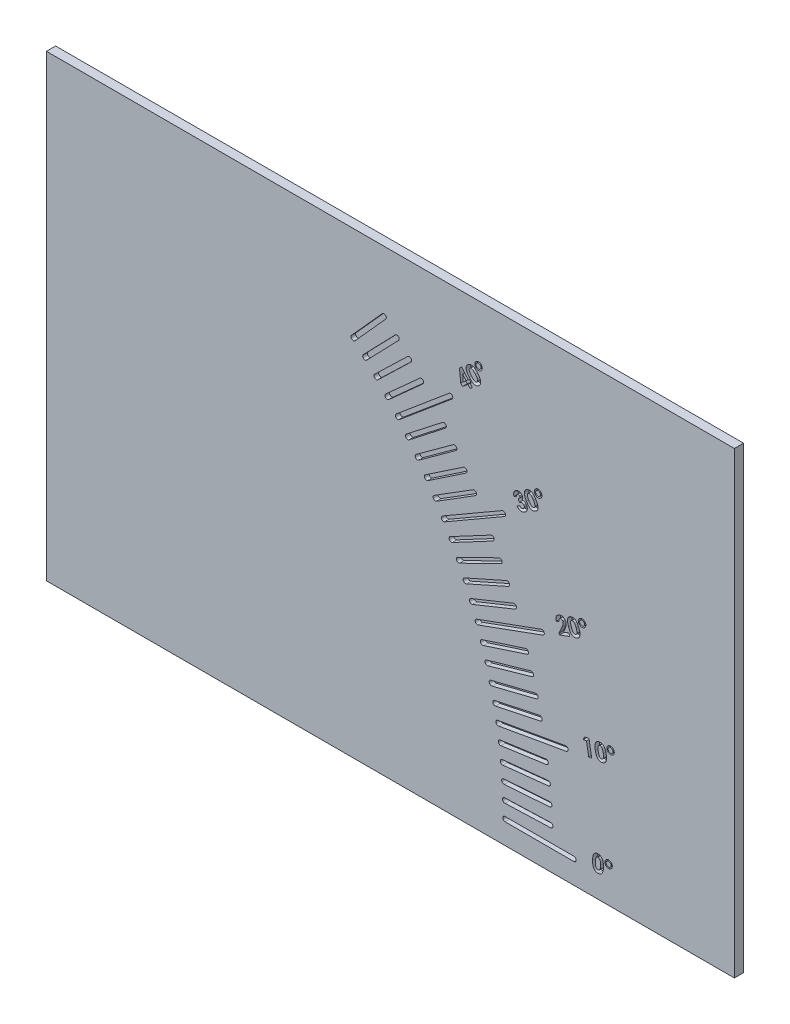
from build123d import *

# Parameters (mm, degrees)
ESQUISSE1_W              = 150
ESQUISSE1_H              = 100
BASE_DEPTH               = 2
GRADUATION_10_DEPTH      = 1
GRADUATION_5_DEPTH       = 1
F_4_GRADUATIONS_2_COUNT  = 4
F_4_GRADUATIONS_2_ANGLE  = 6
GRADUATION_COUNT         = 5
GRADUATION_ANGLE         = 40
GRADUATION_COPY_1_DEPTH  = 1
GRADUATION_COPY_2_DEPTH  = 1
GRADUATION_COPY_3_DEPTH  = 1
GRADUATION_COPY_4_DEPTH  = 1
GRADUATION_COPY_5_DEPTH  = 1
GRADUATION_COPY_6_DEPTH  = 1
GRADUATION_COPY_7_DEPTH  = 1
GRADUATION_COPY_8_DEPTH  = 1
GRADUATION_COPY_9_DEPTH  = 1
GRADUATION_COPY_10_DEPTH = 1
GRADUATION_COPY_11_DEPTH = 1
GRADUATION_COPY_12_DEPTH = 1
TEXTE_DEPTH              = 1


with BuildPart() as part:
    # Esquisse1 → Base (new body)
    with BuildSketch(Plane.XY):
        with Locations((75, 45)):
            Rectangle(ESQUISSE1_W, ESQUISSE1_H)
    extrude(amount=-BASE_DEPTH)

    # Esquisse2 → Graduation 10 (cut)
    with BuildSketch(Plane.XY):
        with BuildLine():
            Line((100, 0.5), (115, 0.5))
            ThreePointArc((115, 0.5), (115.5, 0), (115, -0.5))
            Line((115, -0.5), (100, -0.5))
            ThreePointArc((100, -0.5), (99.5, 0), (100, 0.5))
        make_face()
    graduation_10 = extrude(amount=-GRADUATION_10_DEPTH, mode=Mode.SUBTRACT)

    # Esquisse3 → Graduation 5 (cut)
    with BuildSketch(Plane.XY):
        with BuildLine():
            Line((99.921632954, 3.989645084), (109.915541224, 4.338640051))
            ThreePointArc((109.915541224, 4.338640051), (110.432686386, 3.856394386), (109.95044072, 3.339249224))
            Line((109.95044072, 3.339249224), (99.95653245, 2.990254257))
            ThreePointArc((99.95653245, 2.990254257), (99.439387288, 3.472499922), (99.921632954, 3.989645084))
        make_face()
    graduation_5 = extrude(amount=-GRADUATION_5_DEPTH, mode=Mode.SUBTRACT)

    # 4 graduations 2: Graduation 5 ×4 about axis
    f_4_graduations_2_axis = Axis((0, 0, 0), (0, 0, 1))
    for i in range(1, F_4_GRADUATIONS_2_COUNT):
        add(graduation_5.rotate(f_4_graduations_2_axis, i * F_4_GRADUATIONS_2_ANGLE / (F_4_GRADUATIONS_2_COUNT - 1)), mode=Mode.SUBTRACT)

    # Graduation: Graduation 10, Graduation 5 ×5 about axis
    graduation_axis = Axis((0, 0, 0), (0, 0, 1))
    add([graduation_10.rotate(graduation_axis, i * GRADUATION_ANGLE / (GRADUATION_COUNT - 1)) for i in range(1, GRADUATION_COUNT)], mode=Mode.SUBTRACT)
    add([graduation_5.rotate(graduation_axis, i * GRADUATION_ANGLE / (GRADUATION_COUNT - 1)) for i in range(1, GRADUATION_COUNT)], mode=Mode.SUBTRACT)

    # Graduation copy 1 sketch → Graduation copy 1 (cut)
    with BuildSketch(Plane(origin=(0, 0, 0), x_dir=(0.9781476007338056, 0.20791169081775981, 0), z_dir=(0, 0, 1))):
        with BuildLine():
            Line((99.921632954, 3.989645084), (109.915541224, 4.338640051))
            ThreePointArc((109.915541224, 4.338640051), (110.432686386, 3.856394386), (109.95044072, 3.339249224))
            Line((109.95044072, 3.339249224), (99.95653245, 2.990254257))
            ThreePointArc((99.95653245, 2.990254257), (99.439387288, 3.472499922), (99.921632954, 3.989645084))
        make_face()
    extrude(amount=-GRADUATION_COPY_1_DEPTH, mode=Mode.SUBTRACT)

    # Graduation copy 2 sketch → Graduation copy 2 (cut)
    with BuildSketch(Plane(origin=(0, 0, 0), x_dir=(0.9271838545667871, 0.37460659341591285, 0), z_dir=(0, 0, 1))):
        with BuildLine():
            Line((99.921632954, 3.989645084), (109.915541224, 4.338640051))
            ThreePointArc((109.915541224, 4.338640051), (110.432686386, 3.856394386), (109.95044072, 3.339249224))
            Line((109.95044072, 3.339249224), (99.95653245, 2.990254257))
            ThreePointArc((99.95653245, 2.990254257), (99.439387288, 3.472499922), (99.921632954, 3.989645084))
        make_face()
    extrude(amount=-GRADUATION_COPY_2_DEPTH, mode=Mode.SUBTRACT)

    # Graduation copy 3 sketch → Graduation copy 3 (cut)
    with BuildSketch(Plane(origin=(0, 0, 0), x_dir=(0.8480480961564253, 0.5299192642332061, 0), z_dir=(0, 0, 1))):
        with BuildLine():
            Line((99.921632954, 3.989645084), (109.915541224, 4.338640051))
            ThreePointArc((109.915541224, 4.338640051), (110.432686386, 3.856394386), (109.95044072, 3.339249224))
            Line((109.95044072, 3.339249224), (99.95653245, 2.990254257))
            ThreePointArc((99.95653245, 2.990254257), (99.439387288, 3.472499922), (99.921632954, 3.989645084))
        make_face()
    extrude(amount=-GRADUATION_COPY_3_DEPTH, mode=Mode.SUBTRACT)

    # Graduation copy 4 sketch → Graduation copy 4 (cut)
    with BuildSketch(Plane(origin=(0, 0, 0), x_dir=(0.7431448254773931, 0.6691306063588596, 0), z_dir=(0, 0, 1))):
        with BuildLine():
            Line((99.921632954, 3.989645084), (109.915541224, 4.338640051))
            ThreePointArc((109.915541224, 4.338640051), (110.432686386, 3.856394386), (109.95044072, 3.339249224))
            Line((109.95044072, 3.339249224), (99.95653245, 2.990254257))
            ThreePointArc((99.95653245, 2.990254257), (99.439387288, 3.472499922), (99.921632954, 3.989645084))
        make_face()
    extrude(amount=-GRADUATION_COPY_4_DEPTH, mode=Mode.SUBTRACT)

    # Graduation copy 5 sketch → Graduation copy 5 (cut)
    with BuildSketch(Plane(origin=(0, 0, 0), x_dir=(0.9702957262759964, 0.24192189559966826, 0), z_dir=(0, 0, 1))):
        with BuildLine():
            Line((99.921632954, 3.989645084), (109.915541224, 4.338640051))
            ThreePointArc((109.915541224, 4.338640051), (110.432686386, 3.856394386), (109.95044072, 3.339249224))
            Line((109.95044072, 3.339249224), (99.95653245, 2.990254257))
            ThreePointArc((99.95653245, 2.990254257), (99.439387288, 3.472499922), (99.921632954, 3.989645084))
        make_face()
    extrude(amount=-GRADUATION_COPY_5_DEPTH, mode=Mode.SUBTRACT)

    # Graduation copy 6 sketch → Graduation copy 6 (cut)
    with BuildSketch(Plane(origin=(0, 0, 0), x_dir=(0.9135454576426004, 0.40673664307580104, 0), z_dir=(0, 0, 1))):
        with BuildLine():
            Line((99.921632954, 3.989645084), (109.915541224, 4.338640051))
            ThreePointArc((109.915541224, 4.338640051), (110.432686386, 3.856394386), (109.95044072, 3.339249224))
            Line((109.95044072, 3.339249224), (99.95653245, 2.990254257))
            ThreePointArc((99.95653245, 2.990254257), (99.439387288, 3.472499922), (99.921632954, 3.989645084))
        make_face()
    extrude(amount=-GRADUATION_COPY_6_DEPTH, mode=Mode.SUBTRACT)

    # Graduation copy 7 sketch → Graduation copy 7 (cut)
    with BuildSketch(Plane(origin=(0, 0, 0), x_dir=(0.8290375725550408, 0.559192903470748, 0), z_dir=(0, 0, 1))):
        with BuildLine():
            Line((99.921632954, 3.989645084), (109.915541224, 4.338640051))
            ThreePointArc((109.915541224, 4.338640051), (110.432686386, 3.856394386), (109.95044072, 3.339249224))
            Line((109.95044072, 3.339249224), (99.95653245, 2.990254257))
            ThreePointArc((99.95653245, 2.990254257), (99.439387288, 3.472499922), (99.921632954, 3.989645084))
        make_face()
    extrude(amount=-GRADUATION_COPY_7_DEPTH, mode=Mode.SUBTRACT)

    # Graduation copy 8 sketch → Graduation copy 8 (cut)
    with BuildSketch(Plane(origin=(0, 0, 0), x_dir=(0.71933980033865, 0.6946583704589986, 0), z_dir=(0, 0, 1))):
        with BuildLine():
            Line((99.921632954, 3.989645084), (109.915541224, 4.338640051))
            ThreePointArc((109.915541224, 4.338640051), (110.432686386, 3.856394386), (109.95044072, 3.339249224))
            Line((109.95044072, 3.339249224), (99.95653245, 2.990254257))
            ThreePointArc((99.95653245, 2.990254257), (99.439387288, 3.472499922), (99.921632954, 3.989645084))
        make_face()
    extrude(amount=-GRADUATION_COPY_8_DEPTH, mode=Mode.SUBTRACT)

    # Graduation copy 9 sketch → Graduation copy 9 (cut)
    with BuildSketch(Plane(origin=(0, 0, 0), x_dir=(0.9612616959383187, 0.2756373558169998, 0), z_dir=(0, 0, 1))):
        with BuildLine():
            Line((99.921632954, 3.989645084), (109.915541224, 4.338640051))
            ThreePointArc((109.915541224, 4.338640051), (110.432686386, 3.856394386), (109.95044072, 3.339249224))
            Line((109.95044072, 3.339249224), (99.95653245, 2.990254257))
            ThreePointArc((99.95653245, 2.990254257), (99.439387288, 3.472499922), (99.921632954, 3.989645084))
        make_face()
    extrude(amount=-GRADUATION_COPY_9_DEPTH, mode=Mode.SUBTRACT)

    # Graduation copy 10 sketch → Graduation copy 10 (cut)
    with BuildSketch(Plane(origin=(0, 0, 0), x_dir=(0.8987940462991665, 0.43837114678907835, 0), z_dir=(0, 0, 1))):
        with BuildLine():
            Line((99.921632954, 3.989645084), (109.915541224, 4.338640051))
            ThreePointArc((109.915541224, 4.338640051), (110.432686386, 3.856394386), (109.95044072, 3.339249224))
            Line((109.95044072, 3.339249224), (99.95653245, 2.990254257))
            ThreePointArc((99.95653245, 2.990254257), (99.439387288, 3.472499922), (99.921632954, 3.989645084))
        make_face()
    extrude(amount=-GRADUATION_COPY_10_DEPTH, mode=Mode.SUBTRACT)

    # Graduation copy 11 sketch → Graduation copy 11 (cut)
    with BuildSketch(Plane(origin=(0, 0, 0), x_dir=(0.8090169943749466, 0.5877852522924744, 0), z_dir=(0, 0, 1))):
        with BuildLine():
            Line((99.921632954, 3.989645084), (109.915541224, 4.338640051))
            ThreePointArc((109.915541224, 4.338640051), (110.432686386, 3.856394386), (109.95044072, 3.339249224))
            Line((109.95044072, 3.339249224), (99.95653245, 2.990254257))
            ThreePointArc((99.95653245, 2.990254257), (99.439387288, 3.472499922), (99.921632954, 3.989645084))
        make_face()
    extrude(amount=-GRADUATION_COPY_11_DEPTH, mode=Mode.SUBTRACT)

    # Graduation copy 12 sketch → Graduation copy 12 (cut)
    with BuildSketch(Plane(origin=(0, 0, 0), x_dir=(0.6946583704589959, 0.7193398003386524, 0), z_dir=(0, 0, 1))):
        with BuildLine():
            Line((99.921632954, 3.989645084), (109.915541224, 4.338640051))
            ThreePointArc((109.915541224, 4.338640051), (110.432686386, 3.856394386), (109.95044072, 3.339249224))
            Line((109.95044072, 3.339249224), (99.95653245, 2.990254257))
            ThreePointArc((99.95653245, 2.990254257), (99.439387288, 3.472499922), (99.921632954, 3.989645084))
        make_face()
    extrude(amount=-GRADUATION_COPY_12_DEPTH, mode=Mode.SUBTRACT)

    # Esquisse4 → Texte (cut)
    # profile 1 of 14: a face of its own
    with BuildSketch(Plane.XY):
        with BuildLine():
            add(Edge.make_bspline(
                [(120.255939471, 3.58974359), (120.286347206, 3.589292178), (120.346136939, 3.588404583), (120.43419596, 3.578791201), (120.519021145, 3.564268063), (120.600944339, 3.544013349), (120.679375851, 3.517206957), (120.754886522, 3.485120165), (120.826577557, 3.446069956), (120.895363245, 3.401960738), (120.961217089, 3.352022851), (121.02255634, 3.29509108), (121.080501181, 3.23247543), (121.133797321, 3.163229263), (121.183625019, 3.087982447), (121.229820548, 3.00672305), (121.272030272, 2.919053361), (121.31072726, 2.824815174), (121.345330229, 2.722595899), (121.374476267, 2.611223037), (121.399473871, 2.490671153), (121.420573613, 2.360640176), (121.436521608, 2.220957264), (121.447270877, 2.071715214), (121.454647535, 1.913201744), (121.455249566, 1.804462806), (121.455558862, 1.748597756)],
                knots=[0, 0, 0, 0, 0.879237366, 1.728815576, 2.559023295, 3.367336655, 4.166867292, 4.954216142, 5.737608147, 6.525189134, 7.316157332, 8.124696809, 8.942788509, 9.781158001, 10.649253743, 11.551476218, 12.482711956, 13.461909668, 14.496590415, 15.601789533, 16.789733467, 18.056700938, 19.410929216, 20.8549011, 22.384193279, 24, 24, 24, 24], degree=3))
            add(Edge.make_bspline(
                [(121.455558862, 1.748597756), (121.455224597, 1.692033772), (121.454575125, 1.582130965), (121.447577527, 1.42216765), (121.435527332, 1.271842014), (121.419996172, 1.131169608), (121.398722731, 1.000224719), (121.373808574, 0.878668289), (121.344202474, 0.766544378), (121.308459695, 0.664105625), (121.269996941, 0.569701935), (121.227671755, 0.482203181), (121.182221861, 0.401372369), (121.134689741, 0.325990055), (121.082469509, 0.258278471), (121.028102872, 0.195935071), (120.96922261, 0.141334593), (120.908307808, 0.091663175), (120.843126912, 0.048737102), (120.774352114, 0.011194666), (120.70075728, -0.019256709), (120.623683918, -0.045741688), (120.541818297, -0.064755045), (120.456461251, -0.07984152), (120.366649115, -0.088179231), (120.305501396, -0.089213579), (120.274168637, -0.08974359)],
                knots=[0, 0, 0, 0, 1.643780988, 3.193836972, 4.651895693, 6.025988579, 7.305620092, 8.505800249, 9.631074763, 10.672816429, 11.65661981, 12.592235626, 13.49536222, 14.350718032, 15.179365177, 15.97804903, 16.751647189, 17.51006938, 18.259804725, 19.016521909, 19.783502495, 20.571750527, 21.382245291, 22.22305063, 23.089471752, 24, 24, 24, 24], degree=3))
            add(Edge.make_bspline(
                [(120.274168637, -0.08974359), (120.242836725, -0.089203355), (120.181457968, -0.088145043), (120.091402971, -0.079903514), (120.005593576, -0.06469393), (119.923080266, -0.045595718), (119.844437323, -0.01931531), (119.769287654, 0.012047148), (119.698209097, 0.049355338), (119.631004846, 0.092381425), (119.567904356, 0.141720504), (119.507927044, 0.196844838), (119.451205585, 0.257614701), (119.398602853, 0.324710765), (119.349257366, 0.397237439), (119.303683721, 0.476022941), (119.261909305, 0.560952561), (119.222627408, 0.652144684), (119.188496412, 0.75156257), (119.15812141, 0.860094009), (119.133239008, 0.9786437), (119.113226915, 1.107173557), (119.097249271, 1.245411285), (119.08536374, 1.393423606), (119.078327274, 1.551279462), (119.077684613, 1.659781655), (119.077353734, 1.715645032)],
                knots=[0, 0, 0, 0, 0.917216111, 1.796812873, 2.643793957, 3.46689424, 4.273913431, 5.068098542, 5.848489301, 6.620921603, 7.401012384, 8.190319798, 9.003608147, 9.831726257, 10.68377682, 11.569763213, 12.493818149, 13.453288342, 14.474581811, 15.568529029, 16.750744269, 18.018426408, 19.375425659, 20.823733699, 22.36466933, 24, 24, 24, 24], degree=3))
            add(Edge.make_bspline(
                [(119.077353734, 1.715645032), (119.077953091, 1.793262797), (119.07910956, 1.943027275), (119.09376518, 2.159393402), (119.115275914, 2.359386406), (119.146870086, 2.542671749), (119.185935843, 2.709928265), (119.235961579, 2.860054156), (119.29291224, 2.995126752), (119.34144152, 3.075144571), (119.36481367, 3.113681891)],
                knots=[0, 0, 0, 0, 1.288568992, 2.486310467, 3.599230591, 4.627010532, 5.572937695, 6.447898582, 7.252493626, 8, 8, 8, 8], degree=3))
            add(Edge.make_bspline(
                [(119.36481367, 3.113681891), (119.391989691, 3.151540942), (119.445124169, 3.225562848), (119.538031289, 3.322739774), (119.637847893, 3.405850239), (119.746624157, 3.47301338), (119.86263974, 3.525978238), (119.986890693, 3.563386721), (120.11891818, 3.585182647), (120.209583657, 3.588200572), (120.255939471, 3.58974359)],
                knots=[0, 0, 0, 0, 1.058512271, 2.069600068, 3.047294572, 4.004278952, 4.967380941, 5.939006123, 6.946246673, 8, 8, 8, 8], degree=3))
        make_face()
        with BuildLine():
            add(Edge.make_bspline(
                [(120.27136415, 2.961538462), (120.243875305, 2.960235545), (120.189982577, 2.957681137), (120.11178166, 2.935997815), (120.038043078, 2.902506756), (119.981952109, 2.862205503), (119.939968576, 2.823571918), (119.91063438, 2.788609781), (119.882346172, 2.749594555), (119.857360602, 2.704765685), (119.833767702, 2.655733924), (119.810710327, 2.602276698), (119.791809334, 2.543080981), (119.773239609, 2.479154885), (119.756970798, 2.408731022), (119.743341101, 2.331233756), (119.731164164, 2.246159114), (119.722670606, 2.153451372), (119.71475206, 2.053207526), (119.709075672, 1.945204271), (119.706702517, 1.829470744), (119.705948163, 1.749766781), (119.705558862, 1.708633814)],
                knots=[0, 0, 0, 0, 1.076674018, 2.110852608, 3.161083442, 4.239746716, 4.804137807, 5.395870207, 6.026861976, 6.692161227, 7.405688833, 8.16177676, 8.973626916, 9.841385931, 10.773283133, 11.807421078, 12.927755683, 14.143907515, 15.458935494, 16.872852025, 18.386167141, 20, 20, 20, 20], degree=3))
            add(Edge.make_bspline(
                [(119.705558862, 1.708633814), (119.706199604, 1.655344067), (119.707428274, 1.553157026), (119.713863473, 1.406208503), (119.726762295, 1.272473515), (119.742805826, 1.151045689), (119.765339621, 1.042712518), (119.79126621, 0.94644907), (119.823283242, 0.86348247), (119.860285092, 0.792612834), (119.901266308, 0.732324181), (119.945753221, 0.681078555), (119.992231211, 0.636702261), (120.042151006, 0.600655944), (120.095393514, 0.573031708), (120.151514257, 0.553161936), (120.210548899, 0.540998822), (120.250975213, 0.539312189), (120.27136415, 0.538461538)],
                knots=[0, 0, 0, 0, 1.771748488, 3.397459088, 4.888034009, 6.237357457, 7.467047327, 8.564189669, 9.548206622, 10.417051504, 11.216568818, 11.965764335, 12.669334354, 13.348544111, 14.005342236, 14.656555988, 15.322436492, 16, 16, 16, 16], degree=3))
            add(Edge.make_bspline(
                [(120.27136415, 0.538461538), (120.291053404, 0.539043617), (120.329602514, 0.540183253), (120.385815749, 0.551881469), (120.438974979, 0.570900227), (120.488919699, 0.597803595), (120.535828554, 0.632015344), (120.579472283, 0.673685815), (120.619521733, 0.723230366), (120.642854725, 0.759999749), (120.654877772, 0.778946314)],
                knots=[0, 0, 0, 0, 0.992283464, 1.942767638, 2.88273346, 3.832339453, 4.79467288, 5.803907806, 6.868395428, 8, 8, 8, 8], degree=3))
            add(Edge.make_bspline(
                [(120.654877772, 0.778946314), (120.669032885, 0.804836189), (120.698715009, 0.859125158), (120.733063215, 0.950735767), (120.76197562, 1.054057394), (120.786860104, 1.169411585), (120.803879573, 1.29725331), (120.818536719, 1.436771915), (120.825606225, 1.588669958), (120.826756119, 1.69390547), (120.827353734, 1.748597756)],
                knots=[0, 0, 0, 0, 0.710965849, 1.490837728, 2.352621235, 3.297892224, 4.334225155, 5.461620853, 6.680770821, 8, 8, 8, 8], degree=3))
            add(Edge.make_bspline(
                [(120.827353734, 1.748597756), (120.827122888, 1.803764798), (120.826678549, 1.909951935), (120.818526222, 2.062396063), (120.807173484, 2.201628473), (120.790567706, 2.327338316), (120.769201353, 2.439830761), (120.742867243, 2.539098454), (120.711821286, 2.625337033), (120.675004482, 2.698460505), (120.634227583, 2.760605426), (120.59094166, 2.813920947), (120.544963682, 2.859440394), (120.49637054, 2.897335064), (120.444037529, 2.926289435), (120.388964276, 2.946733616), (120.331037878, 2.959101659), (120.291523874, 2.960715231), (120.27136415, 2.961538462)],
                knots=[0, 0, 0, 0, 1.793836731, 3.452829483, 4.963243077, 6.335886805, 7.574563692, 8.684454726, 9.672768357, 10.54971625, 11.340229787, 12.085688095, 12.778991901, 13.440269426, 14.083255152, 14.715733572, 15.344777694, 16, 16, 16, 16], degree=3))
        make_face(mode=Mode.SUBTRACT)
    # profile 2 of 14: a face of its own
    with BuildSketch(Plane.XY):
        with BuildLine():
            add(Edge.make_bspline(
                [(123.385046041, 2.782051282), (123.384443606, 2.754203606), (123.383258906, 2.699440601), (123.371757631, 2.618823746), (123.352489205, 2.541817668), (123.327784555, 2.467303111), (123.293458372, 2.3972013), (123.252823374, 2.32995636), (123.20376954, 2.266820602), (123.149078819, 2.207044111), (123.088999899, 2.152587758), (123.025183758, 2.104467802), (122.957433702, 2.06461792), (122.887199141, 2.031249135), (122.813526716, 2.005933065), (122.736961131, 1.987900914), (122.657180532, 1.976076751), (122.60287058, 1.97493807), (122.575250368, 1.974358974)],
                knots=[0, 0, 0, 0, 1.048753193, 2.062393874, 3.059725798, 4.03711221, 5.013824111, 5.993903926, 6.992478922, 8.020738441, 9.043061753, 10.043343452, 11.026424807, 11.999358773, 12.968420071, 13.955122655, 14.960044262, 16, 16, 16, 16], degree=3))
            add(Edge.make_bspline(
                [(122.575250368, 1.974358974), (122.547628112, 1.974932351), (122.49331414, 1.976059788), (122.413562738, 1.987965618), (122.33681406, 2.005714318), (122.263466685, 2.032172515), (122.193174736, 2.065079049), (122.126022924, 2.105225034), (122.062606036, 2.153483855), (122.003098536, 2.208272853), (121.948504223, 2.268247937), (121.900688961, 2.33237555), (121.85939094, 2.399593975), (121.827542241, 2.471377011), (121.800964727, 2.545714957), (121.783281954, 2.623887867), (121.771326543, 2.705259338), (121.770224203, 2.760738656), (121.769661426, 2.7890625)],
                knots=[0, 0, 0, 0, 1.037227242, 2.039512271, 3.023626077, 3.993053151, 4.963434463, 5.936395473, 6.927031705, 7.952593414, 8.972234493, 9.969891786, 10.954906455, 11.929570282, 12.915563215, 13.916770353, 14.936449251, 16, 16, 16, 16], degree=3))
            add(Edge.make_bspline(
                [(121.769661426, 2.7890625), (121.770248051, 2.816214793), (121.771401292, 2.869593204), (121.783154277, 2.948276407), (121.801807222, 3.024014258), (121.828669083, 3.096558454), (121.862935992, 3.165799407), (121.903227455, 3.232967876), (121.953101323, 3.295868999), (122.008684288, 3.355894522), (122.069641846, 3.410667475), (122.13434624, 3.458722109), (122.202141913, 3.498868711), (122.272569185, 3.531960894), (122.345728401, 3.55825665), (122.422185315, 3.57623741), (122.501268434, 3.58795646), (122.55510948, 3.589144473), (122.582261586, 3.58974359)],
                knots=[0, 0, 0, 0, 1.027628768, 2.020204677, 3.0054932, 3.977172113, 4.942988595, 5.928118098, 6.937247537, 7.976812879, 9.023474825, 10.036014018, 11.024160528, 12.002107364, 12.979092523, 13.962271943, 14.972371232, 16, 16, 16, 16], degree=3))
            add(Edge.make_bspline(
                [(122.582261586, 3.58974359), (122.609416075, 3.589160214), (122.663030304, 3.588008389), (122.741852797, 3.57613887), (122.817901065, 3.55838039), (122.890564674, 3.531948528), (122.960277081, 3.498840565), (123.027282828, 3.458889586), (123.090734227, 3.410647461), (123.150176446, 3.35559014), (123.205550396, 3.296110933), (123.253127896, 3.231824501), (123.294491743, 3.165075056), (123.327176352, 3.094499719), (123.353699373, 3.021197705), (123.371514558, 2.944215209), (123.383299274, 2.864214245), (123.384458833, 2.809671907), (123.385046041, 2.782051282)],
                knots=[0, 0, 0, 0, 1.02774298, 2.029191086, 3.012479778, 3.981238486, 4.951290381, 5.931946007, 6.930416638, 7.964088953, 8.997761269, 10.003308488, 10.98854748, 11.966603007, 12.943696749, 13.935593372, 14.954569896, 16, 16, 16, 16], degree=3))
        make_face()
        with BuildLine():
            add(Edge.make_bspline(
                [(123.115815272, 2.778545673), (123.115556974, 2.797275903), (123.115047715, 2.834204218), (123.106645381, 2.888315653), (123.095062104, 2.940529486), (123.07819917, 2.990377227), (123.056440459, 3.037689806), (123.029182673, 3.082265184), (122.997900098, 3.125069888), (122.961459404, 3.164781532), (122.92165903, 3.200646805), (122.880473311, 3.233691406), (122.835897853, 3.260245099), (122.789432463, 3.281724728), (122.741437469, 3.300122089), (122.690830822, 3.311174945), (122.638411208, 3.319817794), (122.602633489, 3.32027789), (122.584364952, 3.320512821)],
                knots=[0, 0, 0, 0, 1.061377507, 2.092600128, 3.099240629, 4.0928758, 5.071628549, 6.047053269, 7.052033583, 8.074955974, 9.097878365, 10.089742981, 11.0651677, 12.031904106, 12.992438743, 13.973254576, 14.965119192, 16, 16, 16, 16], degree=3))
            add(Edge.make_bspline(
                [(122.584364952, 3.320512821), (122.565867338, 3.320247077), (122.52917048, 3.319719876), (122.475542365, 3.31134342), (122.423592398, 3.300018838), (122.374472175, 3.281645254), (122.326375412, 3.260683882), (122.281621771, 3.232300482), (122.237542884, 3.201339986), (122.197801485, 3.163937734), (122.160282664, 3.124456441), (122.128342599, 3.081572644), (122.100583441, 3.037162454), (122.077852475, 2.990447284), (122.060609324, 2.94145503), (122.047572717, 2.890602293), (122.04083685, 2.837619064), (122.039547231, 2.801698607), (122.038892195, 2.783453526)],
                knots=[0, 0, 0, 0, 1.04110597, 2.065418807, 3.052483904, 4.031345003, 5.015506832, 6.002484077, 7.011358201, 8.046031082, 9.071020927, 10.07714091, 11.052896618, 12.018827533, 12.997688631, 13.975042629, 14.971463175, 16, 16, 16, 16], degree=3))
            add(Edge.make_bspline(
                [(122.038892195, 2.783453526), (122.039545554, 2.765441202), (122.040831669, 2.729984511), (122.047589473, 2.677707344), (122.060550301, 2.62751533), (122.078232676, 2.578968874), (122.100243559, 2.531759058), (122.129157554, 2.487638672), (122.161357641, 2.44424404), (122.19892709, 2.403618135), (122.239581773, 2.366115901), (122.283120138, 2.333394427), (122.328251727, 2.305345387), (122.375637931, 2.282880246), (122.42443134, 2.265140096), (122.475124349, 2.252300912), (122.528093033, 2.245526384), (122.564015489, 2.24424208), (122.582261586, 2.243589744)],
                knots=[0, 0, 0, 0, 1.017878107, 2.003660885, 2.970612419, 3.939454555, 4.919652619, 5.904816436, 6.913406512, 7.969270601, 9.02513469, 10.033724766, 11.041277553, 12.021475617, 12.990317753, 13.970071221, 14.968938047, 16, 16, 16, 16], degree=3))
            add(Edge.make_bspline(
                [(122.582261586, 2.243589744), (122.60027197, 2.244247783), (122.63572484, 2.245543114), (122.688029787, 2.2522339), (122.737829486, 2.265366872), (122.786287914, 2.281922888), (122.832203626, 2.304773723), (122.877055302, 2.331259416), (122.918842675, 2.363895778), (122.958598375, 2.400293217), (122.995872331, 2.43945436), (123.027003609, 2.482751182), (123.05481798, 2.526928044), (123.077585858, 2.573334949), (123.093907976, 2.622081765), (123.107272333, 2.672292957), (123.113809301, 2.724857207), (123.115142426, 2.760537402), (123.115815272, 2.778545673)],
                knots=[0, 0, 0, 0, 1.030660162, 2.028821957, 3.007916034, 3.971836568, 4.952298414, 5.935762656, 6.946377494, 7.977730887, 9.018140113, 10.031403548, 11.021837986, 12.002299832, 12.978835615, 13.957929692, 14.969339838, 16, 16, 16, 16], degree=3))
        make_face(mode=Mode.SUBTRACT)
    # profile 3 of 14: a face of its own
    with BuildSketch(Plane.XY):
        Polygon((117.315919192, 24.208877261), (118.289076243, 24.380652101), (118.891339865, 20.964085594), (118.245606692, 20.849802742), (117.750614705, 23.655692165), (117.047389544, 23.531593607), align=None)
    # profile 4 of 14: a face of its own
    with BuildSketch(Plane.XY):
        with BuildLine():
            add(Edge.make_bspline(
                [(120.535252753, 24.864371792), (120.566048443, 24.869235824), (120.626492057, 24.878782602), (120.716951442, 24.885673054), (120.805032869, 24.886488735), (120.891073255, 24.880998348), (120.974636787, 24.86875612), (121.056248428, 24.851814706), (121.135293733, 24.826623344), (121.212306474, 24.796019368), (121.2870832, 24.758796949), (121.358600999, 24.714286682), (121.427719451, 24.663661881), (121.4938189, 24.605913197), (121.556709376, 24.540912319), (121.618112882, 24.470320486), (121.67546213, 24.391909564), (121.730394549, 24.306774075), (121.782656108, 24.213148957), (121.832582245, 24.110449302), (121.877538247, 23.996595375), (121.921329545, 23.873568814), (121.960540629, 23.73986816), (121.999024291, 23.597087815), (122.032079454, 23.443604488), (122.052020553, 23.337841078), (122.062296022, 23.283342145)],
                knots=[0, 0, 0, 0, 0.899528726, 1.765531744, 2.615440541, 3.440109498, 4.250924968, 5.051320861, 5.842799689, 6.641915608, 7.441287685, 8.249939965, 9.070183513, 9.911564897, 10.77966681, 11.678816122, 12.609663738, 13.580699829, 14.601417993, 15.702543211, 16.873667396, 18.132310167, 19.470306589, 20.893697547, 22.399350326, 24, 24, 24, 24], degree=3))
            add(Edge.make_bspline(
                [(122.062296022, 23.283342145), (122.07151834, 23.228006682), (122.089419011, 23.12059964), (122.109878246, 22.963225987), (122.123662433, 22.81447721), (122.133105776, 22.674434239), (122.133222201, 22.542909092), (122.128884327, 22.420032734), (122.117812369, 22.305508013), (122.100433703, 22.199157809), (122.076655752, 22.100138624), (122.049775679, 22.007054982), (122.01803065, 21.91975039), (121.982509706, 21.83795292), (121.941746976, 21.762478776), (121.897319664, 21.692177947), (121.848468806, 21.627742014), (121.794575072, 21.568989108), (121.73616415, 21.51549572), (121.672801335, 21.466963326), (121.604505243, 21.423427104), (121.53117876, 21.384580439), (121.452187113, 21.351177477), (121.368486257, 21.321654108), (121.27931241, 21.297811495), (121.217989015, 21.285724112), (121.1865949, 21.279536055)],
                knots=[0, 0, 0, 0, 1.626187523, 3.156456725, 4.599137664, 5.956577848, 7.223524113, 8.410100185, 9.519735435, 10.556689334, 11.531185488, 12.4702038, 13.363915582, 14.222420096, 15.052960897, 15.847979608, 16.631190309, 17.393643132, 18.156095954, 18.92442588, 19.704377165, 20.501442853, 21.32699471, 22.188354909, 23.072540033, 24, 24, 24, 24], degree=3))
            add(Edge.make_bspline(
                [(121.1865949, 21.279536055), (121.15509944, 21.274425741), (121.093035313, 21.26435549), (121.000714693, 21.25701003), (120.91118927, 21.254959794), (120.824833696, 21.261358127), (120.740973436, 21.271018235), (120.660135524, 21.288936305), (120.582013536, 21.312723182), (120.506714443, 21.342993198), (120.434258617, 21.379611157), (120.36428113, 21.422657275), (120.297352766, 21.472591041), (120.232165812, 21.528289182), (120.17024691, 21.590777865), (120.110027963, 21.658999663), (120.053633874, 21.734508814), (119.998248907, 21.816126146), (119.94608498, 21.906710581), (119.897024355, 22.00714637), (119.851776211, 22.118375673), (119.809106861, 22.239850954), (119.769270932, 22.371832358), (119.732470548, 22.514107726), (119.69762208, 22.66666345), (119.678521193, 22.772372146), (119.668666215, 22.826911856)],
                knots=[0, 0, 0, 0, 0.931403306, 1.835398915, 2.702255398, 3.543478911, 4.362056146, 5.165239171, 5.957532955, 6.744547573, 7.532005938, 8.325621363, 9.140520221, 9.968123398, 10.827126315, 11.70733973, 12.623236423, 13.577244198, 14.586298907, 15.672899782, 16.83890164, 18.090837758, 19.431575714, 20.863449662, 22.381717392, 24, 24, 24, 24], degree=3))
            add(Edge.make_bspline(
                [(119.668666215, 22.826911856), (119.655955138, 22.90275381), (119.631429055, 23.049091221), (119.608720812, 23.262845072), (119.596136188, 23.461929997), (119.595354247, 23.646525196), (119.608021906, 23.816432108), (119.631180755, 23.972095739), (119.666470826, 24.113765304), (119.70159422, 24.2002714), (119.718445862, 24.241775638)],
                knots=[0, 0, 0, 0, 1.285920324, 2.481189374, 3.593287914, 4.621313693, 5.565968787, 6.439986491, 7.251530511, 8, 8, 8, 8], degree=3))
            add(Edge.make_bspline(
                [(119.718445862, 24.241775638), (119.739233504, 24.283438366), (119.780007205, 24.365157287), (119.856379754, 24.476822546), (119.944088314, 24.574706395), (120.041117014, 24.660706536), (120.149884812, 24.731810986), (120.268450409, 24.790319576), (120.397783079, 24.835667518), (120.488711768, 24.854653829), (120.535252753, 24.864371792)],
                knots=[0, 0, 0, 0, 1.042127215, 2.044069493, 3.019243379, 3.980090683, 4.939867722, 5.920870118, 6.935817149, 8, 8, 8, 8], degree=3))
        make_face()
        with BuildLine():
            add(Edge.make_bspline(
                [(120.660052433, 24.249487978), (120.633325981, 24.243724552), (120.580870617, 24.232412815), (120.507909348, 24.197969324), (120.441893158, 24.151888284), (120.393323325, 24.103293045), (120.358921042, 24.058020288), (120.335840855, 24.019147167), (120.31528027, 23.976010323), (120.298257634, 23.928142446), (120.282393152, 23.876381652), (120.271008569, 23.81970027), (120.261083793, 23.75893497), (120.253919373, 23.69318371), (120.250874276, 23.621555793), (120.249757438, 23.543420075), (120.254032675, 23.458093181), (120.260044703, 23.365715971), (120.270080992, 23.266130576), (120.283484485, 23.159543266), (120.300297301, 23.04592881), (120.313763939, 22.968043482), (120.320709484, 22.927873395)],
                knots=[0, 0, 0, 0, 1.076915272, 2.113635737, 3.161027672, 4.244569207, 4.811360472, 5.403446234, 6.026937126, 6.695728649, 7.408377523, 8.163353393, 8.976789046, 9.840228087, 10.773708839, 11.80763091, 12.925544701, 14.146876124, 15.464044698, 16.878088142, 18.389844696, 20, 20, 20, 20], degree=3))
            add(Edge.make_bspline(
                [(120.320709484, 22.927873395), (120.330451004, 22.876162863), (120.349198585, 22.776645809), (120.381073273, 22.634535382), (120.415987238, 22.505802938), (120.453713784, 22.39034575), (120.493970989, 22.288130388), (120.536533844, 22.198974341), (120.581852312, 22.123214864), (120.630642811, 22.060531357), (120.682231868, 22.009632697), (120.733945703, 21.966346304), (120.787549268, 21.931526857), (120.842808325, 21.9054114), (120.899476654, 21.886612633), (120.957859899, 21.876944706), (121.017835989, 21.875372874), (121.057626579, 21.880557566), (121.077921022, 21.88320192)],
                knots=[0, 0, 0, 0, 1.762355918, 3.391658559, 4.876627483, 6.228164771, 7.457881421, 8.553671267, 9.533662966, 10.408998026, 11.206037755, 11.956719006, 12.664549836, 13.34031848, 13.998773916, 14.657647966, 15.315358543, 16, 16, 16, 16], degree=3))
            add(Edge.make_bspline(
                [(121.077921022, 21.88320192), (121.096975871, 21.88741567), (121.134608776, 21.895737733), (121.188184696, 21.91604149), (121.237199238, 21.943874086), (121.281879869, 21.97834598), (121.321089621, 22.020674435), (121.357352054, 22.06838273), (121.388108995, 22.123602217), (121.404580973, 22.163468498), (121.41305724, 22.18398317)],
                knots=[0, 0, 0, 0, 0.989292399, 1.953830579, 2.893635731, 3.840000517, 4.804538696, 5.812416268, 6.874297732, 8, 8, 8, 8], degree=3))
            add(Edge.make_bspline(
                [(121.41305724, 22.18398317), (121.422296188, 22.211864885), (121.441664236, 22.270314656), (121.459901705, 22.36587093), (121.470524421, 22.471876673), (121.474977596, 22.58877264), (121.469624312, 22.716523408), (121.459415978, 22.855512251), (121.441044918, 23.005469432), (121.423535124, 23.108595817), (121.414459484, 23.162048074)],
                knots=[0, 0, 0, 0, 0.712777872, 1.494230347, 2.356123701, 3.298976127, 4.332592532, 5.45968621, 6.683309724, 8, 8, 8, 8], degree=3))
            add(Edge.make_bspline(
                [(121.414459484, 23.162048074), (121.404517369, 23.215868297), (121.38543878, 23.319147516), (121.35254237, 23.466788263), (121.317162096, 23.600713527), (121.27888091, 23.72057923), (121.238218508, 23.826449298), (121.195718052, 23.918832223), (121.150918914, 23.997955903), (121.101690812, 24.062703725), (121.05084, 24.115886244), (121.00001586, 24.161623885), (120.946340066, 24.197287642), (120.891909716, 24.225307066), (120.835939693, 24.24451405), (120.778326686, 24.255099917), (120.719198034, 24.257527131), (120.679877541, 24.252182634), (120.660052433, 24.249487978)],
                knots=[0, 0, 0, 0, 1.793295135, 3.44127381, 4.955208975, 6.330806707, 7.562398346, 8.669034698, 9.660716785, 10.535279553, 11.326176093, 12.069639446, 12.770550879, 13.431544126, 14.07088913, 14.701738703, 15.345426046, 16, 16, 16, 16], degree=3))
        make_face(mode=Mode.SUBTRACT)
    # profile 5 of 14: a face of its own
    with BuildSketch(Plane.XY):
        with BuildLine():
            add(Edge.make_bspline(
                [(123.80366484, 24.617522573), (123.808002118, 24.58977419), (123.816532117, 24.535202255), (123.818886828, 24.453388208), (123.814115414, 24.373814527), (123.801693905, 24.296143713), (123.780146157, 24.22064818), (123.751591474, 24.147005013), (123.714578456, 24.075406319), (123.670138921, 24.007077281), (123.619944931, 23.942551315), (123.564571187, 23.884506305), (123.505120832, 23.832640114), (123.44116582, 23.787400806), (123.37213034, 23.749930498), (123.299428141, 23.717767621), (123.221986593, 23.693264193), (123.168328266, 23.682220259), (123.141104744, 23.676617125)],
                knots=[0, 0, 0, 0, 1.050540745, 2.066067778, 3.056638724, 4.031866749, 5.004146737, 5.990380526, 6.984307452, 8.015728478, 9.037867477, 10.040421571, 11.014117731, 11.987499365, 12.966487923, 13.949923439, 14.959894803, 16, 16, 16, 16], degree=3))
            add(Edge.make_bspline(
                [(123.141104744, 23.676617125), (123.113578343, 23.672656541), (123.05941438, 23.664863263), (122.978170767, 23.661141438), (122.898998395, 23.666113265), (122.821744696, 23.678899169), (122.74618634, 23.699167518), (122.672885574, 23.728177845), (122.60109185, 23.764214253), (122.53249166, 23.808192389), (122.467836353, 23.858043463), (122.409111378, 23.913196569), (122.356822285, 23.9728359), (122.312084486, 24.037854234), (122.272920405, 24.106806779), (122.241655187, 24.181077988), (122.215909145, 24.259558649), (122.205017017, 24.314263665), (122.199498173, 24.341981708)],
                knots=[0, 0, 0, 0, 1.038183, 2.042842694, 3.030988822, 3.995217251, 4.96279747, 5.946617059, 6.934146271, 7.958330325, 8.984854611, 9.9789573, 10.962583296, 11.940734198, 12.921568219, 13.918616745, 14.945400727, 16, 16, 16, 16], degree=3))
            add(Edge.make_bspline(
                [(122.199498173, 24.341981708), (122.195389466, 24.369032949), (122.187309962, 24.422227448), (122.185702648, 24.502172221), (122.191069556, 24.580147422), (122.204608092, 24.656478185), (122.225591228, 24.731326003), (122.25533776, 24.804254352), (122.292753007, 24.875737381), (122.338159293, 24.944105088), (122.388587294, 25.009016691), (122.444482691, 25.067451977), (122.504104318, 25.119972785), (122.568711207, 25.164425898), (122.636858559, 25.20300758), (122.709199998, 25.234507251), (122.786056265, 25.259269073), (122.839267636, 25.270286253), (122.866265, 25.275875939)],
                knots=[0, 0, 0, 0, 1.029241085, 2.023935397, 3.003213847, 3.968154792, 4.93753908, 5.92449672, 6.92818035, 7.970318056, 9.010671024, 10.018972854, 11.010665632, 11.996838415, 12.966062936, 13.955136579, 14.962516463, 16, 16, 16, 16], degree=3))
            add(Edge.make_bspline(
                [(122.866265, 25.275875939), (122.893319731, 25.279918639), (122.946759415, 25.287903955), (123.026883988, 25.290420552), (123.105325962, 25.285655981), (123.182110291, 25.272854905), (123.257504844, 25.252779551), (123.330433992, 25.223424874), (123.402104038, 25.187633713), (123.470456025, 25.143543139), (123.535582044, 25.09429297), (123.594526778, 25.039557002), (123.646779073, 24.980440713), (123.692024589, 24.916692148), (123.730669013, 24.84861941), (123.762436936, 24.775803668), (123.787038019, 24.698415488), (123.798068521, 24.64474982), (123.80366484, 24.617522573)],
                knots=[0, 0, 0, 0, 1.029338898, 2.033195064, 3.011973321, 3.984201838, 4.959809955, 5.943599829, 6.939322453, 7.97200404, 9.001681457, 10.010463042, 10.99562959, 11.967499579, 12.948806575, 13.937974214, 14.953832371, 16, 16, 16, 16], degree=3))
        make_face()
        with BuildLine():
            add(Edge.make_bspline(
                [(123.528123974, 24.564237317), (123.524195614, 24.583000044), (123.516509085, 24.619712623), (123.500396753, 24.672936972), (123.479348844, 24.72269348), (123.453786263, 24.769283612), (123.424555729, 24.813215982), (123.389614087, 24.85285231), (123.351875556, 24.890732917), (123.309246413, 24.923608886), (123.264598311, 24.95312496), (123.218285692, 24.977988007), (123.170380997, 24.996736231), (123.121384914, 25.011092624), (123.071336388, 25.02016847), (123.019854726, 25.023726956), (122.967448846, 25.021587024), (122.932367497, 25.016318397), (122.914642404, 25.013656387)],
                knots=[0, 0, 0, 0, 1.084874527, 2.122747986, 3.142502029, 4.137143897, 5.12790663, 6.122372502, 7.123417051, 8.150354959, 9.163133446, 10.151508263, 11.119483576, 12.069940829, 13.037916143, 13.992783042, 14.985839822, 16, 16, 16, 16], degree=3))
            add(Edge.make_bspline(
                [(122.914642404, 25.013656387), (122.896559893, 25.010032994), (122.861144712, 25.00293646), (122.809965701, 24.986399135), (122.761584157, 24.9656907), (122.716500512, 24.939317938), (122.67427164, 24.909026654), (122.634586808, 24.874713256), (122.598756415, 24.834697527), (122.565741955, 24.7913028), (122.536088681, 24.745381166), (122.512334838, 24.697264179), (122.492910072, 24.648139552), (122.480225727, 24.597366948), (122.47017642, 24.545945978), (122.468083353, 24.492957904), (122.469863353, 24.438743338), (122.475154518, 24.402478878), (122.477843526, 24.384049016)],
                knots=[0, 0, 0, 0, 1.037155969, 2.031303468, 3.020916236, 3.993246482, 4.964152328, 5.942866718, 6.939100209, 7.98083305, 9.00978341, 10.009743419, 10.996555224, 11.975976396, 12.951237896, 13.939100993, 14.952636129, 16, 16, 16, 16], degree=3))
            add(Edge.make_bspline(
                [(122.477843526, 24.384049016), (122.481416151, 24.366182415), (122.488470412, 24.330904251), (122.505950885, 24.280191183), (122.526560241, 24.231858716), (122.552313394, 24.186356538), (122.582368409, 24.143393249), (122.617960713, 24.103561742), (122.656947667, 24.065292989), (122.701015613, 24.031450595), (122.747578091, 24.00165735), (122.795212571, 23.976058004), (122.844175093, 23.956344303), (122.893878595, 23.941464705), (122.944911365, 23.93217134), (122.996849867, 23.929043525), (123.049751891, 23.929949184), (123.084820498, 23.935387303), (123.102543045, 23.938135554)],
                knots=[0, 0, 0, 0, 1.025912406, 2.025696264, 3.016850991, 3.984170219, 4.967326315, 5.966155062, 6.990967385, 8.042359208, 9.091106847, 10.104681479, 11.085628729, 12.060987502, 13.024802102, 14.001849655, 14.990199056, 16, 16, 16, 16], degree=3))
            add(Edge.make_bspline(
                [(123.102543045, 23.938135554), (123.119905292, 23.941821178), (123.154333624, 23.949129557), (123.204153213, 23.964979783), (123.250759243, 23.986678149), (123.295252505, 24.011386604), (123.335926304, 24.04239508), (123.374973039, 24.076325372), (123.409754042, 24.116388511), (123.442640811, 24.159131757), (123.47108672, 24.205258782), (123.495309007, 24.252927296), (123.513343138, 24.302235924), (123.526854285, 24.352420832), (123.535503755, 24.403836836), (123.537960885, 24.456481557), (123.536084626, 24.510250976), (123.530806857, 24.546042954), (123.528123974, 24.564237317)],
                knots=[0, 0, 0, 0, 1.012338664, 2.007408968, 2.974024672, 3.941467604, 4.904121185, 5.886244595, 6.887192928, 7.924509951, 8.960455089, 9.974109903, 10.969716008, 11.949664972, 12.936032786, 13.937425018, 14.95151817, 16, 16, 16, 16], degree=3))
        make_face(mode=Mode.SUBTRACT)
    # profile 6 of 14: a face of its own
    with BuildSketch(Plane.XY):
        with BuildLine():
            Line((111.756292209, 43.174702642), (111.151925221, 42.954550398))
            add(Edge.make_bspline(
                [(111.151925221, 42.954550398), (111.13937441, 42.998326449), (111.114806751, 43.084016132), (111.089376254, 43.212652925), (111.075664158, 43.337712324), (111.07448466, 43.45883004), (111.083289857, 43.576001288), (111.103532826, 43.689597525), (111.135986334, 43.799304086), (111.179581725, 43.904396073), (111.232811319, 44.004023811), (111.295290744, 44.097032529), (111.367220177, 44.182139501), (111.447841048, 44.259831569), (111.537203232, 44.330264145), (111.635850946, 44.392500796), (111.743048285, 44.447793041), (111.819099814, 44.477588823), (111.857954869, 44.492811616)],
                knots=[0, 0, 0, 0, 1.153846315, 2.258603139, 3.318957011, 4.337849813, 5.324143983, 6.293157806, 7.256542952, 8.2179594, 9.171975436, 10.114986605, 11.052400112, 11.990767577, 12.948252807, 13.930911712, 14.942893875, 16, 16, 16, 16], degree=3))
            add(Edge.make_bspline(
                [(111.857954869, 44.492811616), (111.906448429, 44.509089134), (112.001118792, 44.54086652), (112.146347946, 44.565416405), (112.288119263, 44.57329247), (112.426597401, 44.561096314), (112.560449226, 44.531053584), (112.688526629, 44.482353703), (112.809511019, 44.414461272), (112.922447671, 44.330960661), (113.024312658, 44.235759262), (113.111235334, 44.131379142), (113.181889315, 44.019806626), (113.215030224, 43.939471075), (113.231452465, 43.899662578)],
                knots=[0, 0, 0, 0, 1.104319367, 2.155880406, 3.172639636, 4.166599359, 5.150804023, 6.129455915, 7.117762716, 8.140379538, 9.159044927, 10.124184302, 11.070481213, 12, 12, 12, 12], degree=3))
            add(Edge.make_bspline(
                [(113.231452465, 43.899662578), (113.239702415, 43.874982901), (113.256364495, 43.825138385), (113.276037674, 43.747641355), (113.290482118, 43.666765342), (113.301141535, 43.582770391), (113.306628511, 43.495436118), (113.307304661, 43.404854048), (113.302777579, 43.311058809), (113.294490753, 43.213457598), (113.28047933, 43.110587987), (113.258360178, 43.001636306), (113.229413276, 42.885656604), (113.193386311, 42.76294996), (113.150827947, 42.633231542), (113.099606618, 42.497032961), (113.042577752, 42.353530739), (113.000136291, 42.256346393), (112.978347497, 42.206453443)],
                knots=[0, 0, 0, 0, 0.711943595, 1.437882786, 2.185528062, 2.958961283, 3.75365272, 4.578697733, 5.436554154, 6.322464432, 7.258592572, 8.275799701, 9.363148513, 10.528921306, 11.774748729, 13.098170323, 14.510245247, 16, 16, 16, 16], degree=3))
            Line((112.978347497, 42.206453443), (112.753988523, 41.687623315))
            Line((112.753988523, 41.687623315), (113.913643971, 42.109698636))
            Line((113.913643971, 42.109698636), (114.121877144, 41.536882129))
            Line((114.121877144, 41.536882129), (111.867069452, 40.716569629))
            Line((111.867069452, 40.716569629), (111.759096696, 41.013144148))
            Line((111.759096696, 41.013144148), (112.392209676, 42.405572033))
            add(Edge.make_bspline(
                [(112.392209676, 42.405572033), (112.410655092, 42.446142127), (112.446311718, 42.524567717), (112.494393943, 42.639578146), (112.53737004, 42.747019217), (112.574891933, 42.846803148), (112.605035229, 42.939823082), (112.629577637, 43.025172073), (112.649170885, 43.103138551), (112.665301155, 43.195694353), (112.676702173, 43.301747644), (112.677019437, 43.420396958), (112.665297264, 43.528870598), (112.644686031, 43.59513563), (112.634797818, 43.6269262)],
                knots=[0, 0, 0, 0, 1.258822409, 2.433415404, 3.5207856, 4.527575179, 5.444064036, 6.281953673, 7.036103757, 7.713376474, 8.934539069, 10.043616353, 11.061427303, 12, 12, 12, 12], degree=3))
            add(Edge.make_bspline(
                [(112.634797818, 43.6269262), (112.622347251, 43.65647488), (112.598107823, 43.714001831), (112.543800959, 43.789352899), (112.475402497, 43.849104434), (112.396860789, 43.894679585), (112.310184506, 43.92452211), (112.218324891, 43.935757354), (112.122748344, 43.928078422), (112.060989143, 43.908428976), (112.029028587, 43.898260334)],
                knots=[0, 0, 0, 0, 1.033776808, 2.01261196, 2.970243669, 3.948146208, 4.929657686, 5.91128536, 6.919084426, 8, 8, 8, 8], degree=3))
            add(Edge.make_bspline(
                [(112.029028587, 43.898260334), (112.012993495, 43.891792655), (111.981430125, 43.879061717), (111.937166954, 43.854884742), (111.896072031, 43.827776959), (111.859337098, 43.795725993), (111.826210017, 43.759745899), (111.796729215, 43.719822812), (111.771577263, 43.67588147), (111.749645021, 43.62916671), (111.732974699, 43.579254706), (111.720985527, 43.527126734), (111.714090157, 43.472887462), (111.711809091, 43.416786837), (111.715688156, 43.358855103), (111.724205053, 43.299119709), (111.737490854, 43.23723462), (111.74992157, 43.195890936), (111.756292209, 43.174702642)],
                knots=[0, 0, 0, 0, 0.960781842, 1.891196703, 2.79956504, 3.693311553, 4.594679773, 5.51487199, 6.446647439, 7.406109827, 8.380161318, 9.366961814, 10.376103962, 11.416562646, 12.484263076, 13.599928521, 14.769983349, 16, 16, 16, 16], degree=3))
        make_face()
    # profile 7 of 14: a face of its own
    with BuildSketch(Plane.XY):
        with BuildLine():
            add(Edge.make_bspline(
                [(114.343725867, 45.397509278), (114.373034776, 45.407763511), (114.43081742, 45.427979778), (114.51855425, 45.450289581), (114.60532964, 45.465511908), (114.690510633, 45.475780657), (114.774950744, 45.478634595), (114.858166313, 45.474287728), (114.940442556, 45.463785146), (115.021635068, 45.446947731), (115.101418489, 45.42314319), (115.179914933, 45.392205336), (115.256134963, 45.353105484), (115.331798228, 45.308345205), (115.40496806, 45.255472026), (115.477158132, 45.196303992), (115.547038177, 45.12936847), (115.616144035, 45.055420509), (115.684295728, 44.972790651), (115.74949746, 44.879075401), (115.815019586, 44.775952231), (115.878616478, 44.662059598), (115.940793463, 44.537950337), (116.001836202, 44.403382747), (116.062070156, 44.258691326), (116.099666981, 44.157821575), (116.118966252, 44.106042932)],
                knots=[0, 0, 0, 0, 0.896983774, 1.768407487, 2.612283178, 3.441629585, 4.24576181, 5.050461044, 5.847099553, 6.640496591, 7.443919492, 8.250317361, 9.074865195, 9.916901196, 10.788351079, 11.680746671, 12.612278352, 13.582284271, 14.604400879, 15.704325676, 16.879102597, 18.133982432, 19.471979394, 20.889431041, 22.403277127, 24, 24, 24, 24], degree=3))
            add(Edge.make_bspline(
                [(116.118966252, 44.106042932), (116.13783656, 44.053362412), (116.174456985, 43.951128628), (116.22113706, 43.799812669), (116.261470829, 43.656174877), (116.294129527, 43.519678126), (116.317637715, 43.390393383), (116.335396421, 43.268865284), (116.343483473, 43.154296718), (116.345442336, 43.04656699), (116.339279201, 42.945245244), (116.329190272, 42.849184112), (116.312874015, 42.75815073), (116.292218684, 42.671531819), (116.265325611, 42.590098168), (116.234009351, 42.513188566), (116.196618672, 42.441564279), (116.154323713, 42.374391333), (116.10649688, 42.311475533), (116.051985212, 42.253331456), (115.992436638, 42.198440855), (115.926645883, 42.147715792), (115.85498823, 42.100911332), (115.777798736, 42.057397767), (115.69473309, 42.017742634), (115.636303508, 41.995707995), (115.60644622, 41.98444838)],
                knots=[0, 0, 0, 0, 1.62470462, 3.152962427, 4.596928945, 5.956577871, 7.226394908, 8.411667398, 9.520826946, 10.55921868, 11.537951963, 12.466484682, 13.362404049, 14.221587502, 15.049960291, 15.850225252, 16.630294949, 17.392809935, 18.152905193, 18.921226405, 19.704124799, 20.502286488, 21.33046467, 22.187367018, 23.07375162, 24, 24, 24, 24], degree=3))
            add(Edge.make_bspline(
                [(115.60644622, 41.98444838), (115.576197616, 41.973969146), (115.516961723, 41.953447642), (115.427345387, 41.930477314), (115.339782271, 41.91355665), (115.253840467, 41.902694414), (115.169410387, 41.899115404), (115.086650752, 41.902728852), (115.005768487, 41.912519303), (114.926634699, 41.928569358), (114.849069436, 41.952058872), (114.772691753, 41.981980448), (114.698204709, 42.019659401), (114.624772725, 42.063327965), (114.552824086, 42.113981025), (114.481671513, 42.170649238), (114.412936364, 42.235231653), (114.344516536, 42.306117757), (114.27710835, 42.385986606), (114.212403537, 42.477019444), (114.147584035, 42.578076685), (114.085092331, 42.690326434), (114.022957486, 42.813053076), (113.962564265, 42.94687976), (113.901946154, 43.091173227), (113.864492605, 43.191869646), (113.845228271, 43.243663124)],
                knots=[0, 0, 0, 0, 0.935481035, 1.831954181, 2.7015488, 3.541325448, 4.361873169, 5.168768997, 5.960246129, 6.741394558, 7.526000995, 8.326537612, 9.136205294, 9.963409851, 10.821984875, 11.706507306, 12.620179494, 13.576899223, 14.585488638, 15.671965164, 16.839412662, 18.093595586, 19.425742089, 20.859642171, 22.384748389, 24, 24, 24, 24], degree=3))
            add(Edge.make_bspline(
                [(113.845228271, 43.243663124), (113.819795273, 43.316129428), (113.770725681, 43.455943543), (113.710360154, 43.66184878), (113.66337151, 43.855215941), (113.631522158, 44.03648795), (113.613317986, 44.205411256), (113.609339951, 44.362304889), (113.619132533, 44.507593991), (113.638769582, 44.598624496), (113.648213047, 44.642401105)],
                knots=[0, 0, 0, 0, 1.287242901, 2.48356432, 3.595345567, 4.621380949, 5.566724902, 6.440599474, 7.250083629, 8, 8, 8, 8], degree=3))
            add(Edge.make_bspline(
                [(113.648213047, 44.642401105), (113.661379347, 44.687198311), (113.687153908, 44.774894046), (113.743720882, 44.897731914), (113.811298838, 45.010438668), (113.894008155, 45.110170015), (113.986997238, 45.200713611), (114.094036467, 45.2784374), (114.21317997, 45.345993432), (114.299548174, 45.380075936), (114.343725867, 45.397509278)],
                knots=[0, 0, 0, 0, 1.044970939, 2.045651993, 3.020979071, 3.981146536, 4.940356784, 5.921738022, 6.93696041, 8, 8, 8, 8], degree=3))
        make_face()
        with BuildLine():
            add(Edge.make_bspline(
                [(114.573693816, 44.814175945), (114.548446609, 44.803630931), (114.498969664, 44.78296587), (114.433197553, 44.736474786), (114.37638629, 44.679692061), (114.32858, 44.611300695), (114.291866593, 44.529382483), (114.271032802, 44.43195479), (114.264420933, 44.319691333), (114.269484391, 44.216287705), (114.280153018, 44.124895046), (114.294101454, 44.048071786), (114.311400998, 43.964727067), (114.334044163, 43.874967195), (114.361611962, 43.779008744), (114.393256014, 43.676655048), (114.428840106, 43.567816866), (114.455480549, 43.493663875), (114.469226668, 43.455401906)],
                knots=[0, 0, 0, 0, 0.864127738, 1.693430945, 2.530619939, 3.396899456, 4.321042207, 5.353224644, 6.532601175, 7.873268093, 8.625901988, 9.444639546, 10.344435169, 11.320756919, 12.374802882, 13.505322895, 14.712779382, 16, 16, 16, 16], degree=3))
            add(Edge.make_bspline(
                [(114.469226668, 43.455401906), (114.487511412, 43.405928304), (114.522606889, 43.310969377), (114.579574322, 43.177089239), (114.636307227, 43.056449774), (114.693395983, 42.949353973), (114.750614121, 42.855634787), (114.808205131, 42.775864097), (114.865494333, 42.708944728), (114.924293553, 42.655699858), (114.983389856, 42.61393763), (115.041758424, 42.58052626), (115.100515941, 42.555461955), (115.159488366, 42.539310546), (115.218715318, 42.531200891), (115.277647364, 42.532319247), (115.337127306, 42.54018249), (115.375234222, 42.552879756), (115.394707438, 42.559368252)],
                knots=[0, 0, 0, 0, 1.768109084, 3.393683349, 4.876250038, 6.236384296, 7.460637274, 8.554593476, 9.531977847, 10.408491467, 11.206394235, 11.953760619, 12.659554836, 13.341953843, 13.997977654, 14.656197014, 15.31329616, 16, 16, 16, 16], degree=3))
            add(Edge.make_bspline(
                [(115.394707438, 42.559368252), (115.41297465, 42.566513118), (115.448669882, 42.580474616), (115.497077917, 42.610875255), (115.5400092, 42.64692911), (115.578315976, 42.688259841), (115.610083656, 42.736338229), (115.636670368, 42.789764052), (115.658057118, 42.849283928), (115.667016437, 42.89156522), (115.671650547, 42.913434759)],
                knots=[0, 0, 0, 0, 0.994884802, 1.944064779, 2.888328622, 3.83817701, 4.796672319, 5.805773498, 6.865060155, 8, 8, 8, 8], degree=3))
            add(Edge.make_bspline(
                [(115.671650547, 42.913434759), (115.676041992, 42.942353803), (115.685281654, 43.003199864), (115.686193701, 43.100317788), (115.678954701, 43.206444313), (115.662590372, 43.321976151), (115.63579477, 43.446685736), (115.601786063, 43.581423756), (115.556943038, 43.725189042), (115.522606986, 43.823592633), (115.504783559, 43.874672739)],
                knots=[0, 0, 0, 0, 0.711445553, 1.496891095, 2.358007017, 3.300347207, 4.334869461, 5.462423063, 6.682774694, 8, 8, 8, 8], degree=3))
            add(Edge.make_bspline(
                [(115.504783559, 43.874672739), (115.48580041, 43.926016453), (115.449309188, 44.024714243), (115.390298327, 44.163892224), (115.332039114, 44.289331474), (115.274647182, 44.401123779), (115.215443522, 44.497912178), (115.157696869, 44.5816808), (115.098869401, 44.65067345), (115.039973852, 44.706556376), (114.980809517, 44.750331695), (114.922680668, 44.786050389), (114.863920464, 44.812236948), (114.805511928, 44.830010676), (114.746990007, 44.839481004), (114.688693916, 44.840009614), (114.630118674, 44.832718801), (114.592702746, 44.820422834), (114.573693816, 44.814175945)],
                knots=[0, 0, 0, 0, 1.795487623, 3.451457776, 4.957148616, 6.332202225, 7.570754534, 8.676770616, 9.666306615, 10.539507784, 11.333753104, 12.076607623, 12.773284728, 13.437837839, 14.074337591, 14.710698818, 15.344978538, 16, 16, 16, 16], degree=3))
        make_face(mode=Mode.SUBTRACT)
    # profile 8 of 14: a face of its own
    with BuildSketch(Plane.XY):
        with BuildLine():
            add(Edge.make_bspline(
                [(117.562870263, 45.706253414), (117.571827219, 45.67976778), (117.589439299, 45.62768903), (117.606213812, 45.547733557), (117.614592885, 45.468554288), (117.615231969, 45.389913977), (117.608760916, 45.311973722), (117.591833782, 45.234868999), (117.568038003, 45.158336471), (117.536731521, 45.083146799), (117.498411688, 45.011331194), (117.454065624, 44.944577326), (117.404791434, 44.883102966), (117.34999907, 44.827144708), (117.288528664, 44.778274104), (117.22232783, 44.734736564), (117.151136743, 44.695959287), (117.100152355, 44.676433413), (117.074188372, 44.666489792)],
                knots=[0, 0, 0, 0, 1.048202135, 2.061081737, 3.057432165, 4.030715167, 5.007900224, 5.984652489, 6.985775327, 8.011626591, 9.035414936, 10.034885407, 11.013956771, 11.987358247, 12.966429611, 13.95375013, 14.957939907, 16, 16, 16, 16], degree=3))
            add(Edge.make_bspline(
                [(117.074188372, 44.666489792), (117.047943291, 44.657497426), (116.996133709, 44.639745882), (116.9165344, 44.623472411), (116.837724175, 44.613822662), (116.759449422, 44.613346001), (116.681739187, 44.620430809), (116.604368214, 44.635056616), (116.527546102, 44.658412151), (116.452674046, 44.689963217), (116.380399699, 44.727544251), (116.313120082, 44.771580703), (116.251681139, 44.821771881), (116.196055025, 44.877463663), (116.145904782, 44.938551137), (116.102435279, 45.006137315), (116.063343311, 45.078761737), (116.04322581, 45.130854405), (116.033022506, 45.157275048)],
                knots=[0, 0, 0, 0, 1.036450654, 2.046024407, 3.031402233, 4.001508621, 4.966800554, 5.945489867, 6.940777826, 7.963280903, 8.979640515, 9.98314387, 10.964521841, 11.940906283, 12.922284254, 13.913689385, 14.941853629, 16, 16, 16, 16], degree=3))
            add(Edge.make_bspline(
                [(116.033022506, 45.157275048), (116.024284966, 45.183057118), (116.007037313, 45.233950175), (115.991148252, 45.312092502), (115.983355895, 45.389853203), (115.983408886, 45.467357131), (115.990942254, 45.544710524), (116.007342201, 45.621777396), (116.032143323, 45.698192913), (116.064174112, 45.773583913), (116.103222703, 45.845656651), (116.147163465, 45.913468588), (116.197422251, 45.974879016), (116.253033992, 46.03032199), (116.313403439, 46.080377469), (116.379125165, 46.124181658), (116.450236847, 46.161479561), (116.5004734, 46.18136203), (116.525911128, 46.191429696)],
                knots=[0, 0, 0, 0, 1.02576133, 2.024823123, 2.999126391, 3.968594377, 4.942897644, 5.924705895, 6.933670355, 7.968253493, 9.009273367, 10.021274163, 11.010962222, 11.995614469, 12.978490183, 13.963576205, 14.968838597, 16, 16, 16, 16], degree=3))
            add(Edge.make_bspline(
                [(116.525911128, 46.191429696), (116.551942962, 46.200111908), (116.603168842, 46.21719691), (116.681659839, 46.233888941), (116.75980223, 46.24333246), (116.837887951, 46.244112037), (116.91529219, 46.235911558), (116.99244057, 46.221415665), (117.069064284, 46.198126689), (117.144048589, 46.166360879), (117.21650128, 46.129346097), (117.283596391, 46.085210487), (117.34553225, 46.036402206), (117.401247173, 45.981370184), (117.450611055, 45.92055029), (117.493925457, 45.854378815), (117.532595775, 45.783066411), (117.552644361, 45.732198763), (117.562870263, 45.706253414)],
                knots=[0, 0, 0, 0, 1.033019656, 2.032793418, 3.016665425, 3.993898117, 4.967117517, 5.944350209, 6.946949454, 7.976963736, 9.008594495, 10.00728239, 10.997201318, 11.974552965, 12.950754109, 13.942081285, 14.950346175, 16, 16, 16, 16], degree=3))
        make_face()
        with BuildLine():
            add(Edge.make_bspline(
                [(117.300650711, 45.606694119), (117.293688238, 45.624342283), (117.279972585, 45.659108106), (117.254826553, 45.708452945), (117.224965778, 45.753436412), (117.192206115, 45.795050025), (117.155263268, 45.832321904), (117.115304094, 45.866472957), (117.070692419, 45.895669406), (117.008194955, 45.929893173), (116.925830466, 45.960917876), (116.823639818, 45.97747157), (116.719805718, 45.973305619), (116.65367635, 45.952943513), (116.619861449, 45.942531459)],
                knots=[0, 0, 0, 0, 0.808046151, 1.591802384, 2.354011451, 3.105083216, 3.844380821, 4.586355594, 5.340259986, 6.111070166, 7.620226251, 9.062365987, 10.497856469, 12, 12, 12, 12], degree=3))
            add(Edge.make_bspline(
                [(116.619861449, 45.942531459), (116.602898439, 45.93582986), (116.569202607, 45.922517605), (116.521610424, 45.897334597), (116.478027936, 45.867772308), (116.438200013, 45.83429136), (116.401888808, 45.797139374), (116.368499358, 45.756412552), (116.339783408, 45.711003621), (116.306754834, 45.646552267), (116.275885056, 45.562092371), (116.260796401, 45.456654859), (116.267549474, 45.349723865), (116.288657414, 45.281299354), (116.299448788, 45.246317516)],
                knots=[0, 0, 0, 0, 0.770002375, 1.52955578, 2.268823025, 2.990547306, 3.723526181, 4.460482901, 5.210806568, 5.987864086, 7.517837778, 8.983729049, 10.457939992, 12, 12, 12, 12], degree=3))
            add(Edge.make_bspline(
                [(116.299448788, 45.246317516), (116.306101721, 45.229327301), (116.319242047, 45.195769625), (116.344938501, 45.148854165), (116.37360991, 45.104899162), (116.4068306, 45.064768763), (116.444137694, 45.02803359), (116.485927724, 44.995336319), (116.530660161, 44.964659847), (116.595466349, 44.931024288), (116.679604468, 44.899149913), (116.784125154, 44.881714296), (116.889432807, 44.885845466), (116.956237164, 44.906390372), (116.990053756, 44.916790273)],
                knots=[0, 0, 0, 0, 0.773626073, 1.528002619, 2.265232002, 2.997977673, 3.734406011, 4.482562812, 5.247300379, 6.032600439, 7.576542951, 9.044046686, 10.503686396, 12, 12, 12, 12], degree=3))
            add(Edge.make_bspline(
                [(116.990053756, 44.916790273), (117.006576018, 44.923210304), (117.039196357, 44.935885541), (117.085005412, 44.961022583), (117.127931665, 44.989353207), (117.1665082, 45.022800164), (117.202003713, 45.059414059), (117.233648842, 45.100377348), (117.261594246, 45.145366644), (117.293920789, 45.20933862), (117.324490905, 45.293285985), (117.338094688, 45.398250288), (117.332928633, 45.504512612), (117.311551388, 45.572186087), (117.300650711, 45.606694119)],
                knots=[0, 0, 0, 0, 0.758680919, 1.49788378, 2.233824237, 2.958230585, 3.68055789, 4.415612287, 5.171313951, 5.946014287, 7.485091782, 8.970567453, 10.455232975, 12, 12, 12, 12], degree=3))
        make_face(mode=Mode.SUBTRACT)
    # profile 9 of 14: a face of its own
    with BuildSketch(Plane.XY):
        with BuildLine():
            Line((102.490706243, 62.216261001), (101.936820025, 61.896549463))
            add(Edge.make_bspline(
                [(101.936820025, 61.896549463), (101.924913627, 61.926300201), (101.901657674, 61.984410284), (101.875034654, 62.072879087), (101.855240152, 62.159789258), (101.842582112, 62.245573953), (101.83656512, 62.330000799), (101.839044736, 62.41302164), (101.847483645, 62.494852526), (101.859836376, 62.547990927), (101.866006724, 62.574534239)],
                knots=[0, 0, 0, 0, 1.107901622, 2.163988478, 3.191569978, 4.188424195, 5.1605888, 6.114741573, 7.058289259, 8, 8, 8, 8], degree=3))
            add(Edge.make_bspline(
                [(101.866006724, 62.574534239), (101.876280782, 62.610759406), (101.89656799, 62.682289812), (101.939087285, 62.78457979), (101.991294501, 62.880249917), (102.052283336, 62.970004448), (102.124118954, 63.052440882), (102.20476212, 63.129184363), (102.295892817, 63.198840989), (102.36179907, 63.239520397), (102.395353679, 63.260231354)],
                knots=[0, 0, 0, 0, 1.013465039, 2.001193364, 2.975737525, 3.944696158, 4.917572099, 5.914900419, 6.938420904, 8, 8, 8, 8], degree=3))
            add(Edge.make_bspline(
                [(102.395353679, 63.260231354), (102.426138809, 63.277196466), (102.486671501, 63.310554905), (102.581337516, 63.349514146), (102.676162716, 63.38018471), (102.77178849, 63.400598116), (102.867861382, 63.411041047), (102.96436774, 63.412628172), (103.06140117, 63.404156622), (103.157737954, 63.38564694), (103.251203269, 63.359617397), (103.339574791, 63.325565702), (103.422041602, 63.285355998), (103.4976772, 63.236200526), (103.567327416, 63.180342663), (103.629855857, 63.116266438), (103.687670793, 63.04637979), (103.719230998, 62.994240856), (103.735197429, 62.967863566)],
                knots=[0, 0, 0, 0, 1.105415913, 2.173575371, 3.215638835, 4.23839418, 5.244727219, 6.252456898, 7.271264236, 8.304098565, 9.335596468, 10.320412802, 11.280869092, 12.217284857, 13.153440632, 14.084381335, 15.030881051, 16, 16, 16, 16], degree=3))
            add(Edge.make_bspline(
                [(103.735197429, 62.967863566), (103.752740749, 62.933939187), (103.787344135, 62.867024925), (103.822456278, 62.759601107), (103.83862922, 62.648295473), (103.84041452, 62.534302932), (103.824629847, 62.418819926), (103.792053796, 62.303603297), (103.741516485, 62.189400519), (103.696623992, 62.11735558), (103.673498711, 62.080243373)],
                knots=[0, 0, 0, 0, 0.97420217, 1.921568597, 2.86936722, 3.836193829, 4.82364859, 5.834361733, 6.884423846, 8, 8, 8, 8], degree=3))
            add(Edge.make_bspline(
                [(103.673498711, 62.080243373), (103.700074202, 62.085970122), (103.752471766, 62.097261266), (103.831202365, 62.107908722), (103.908312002, 62.111850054), (103.984114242, 62.111109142), (104.058061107, 62.10195637), (104.130703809, 62.089242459), (104.201450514, 62.069094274), (104.270488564, 62.043492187), (104.336709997, 62.011617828), (104.400798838, 61.976276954), (104.459825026, 61.933329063), (104.517358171, 61.887910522), (104.568777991, 61.834906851), (104.618786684, 61.778879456), (104.663886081, 61.716465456), (104.691106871, 61.672134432), (104.704848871, 61.649754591)],
                knots=[0, 0, 0, 0, 1.083064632, 2.135424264, 3.161367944, 4.158024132, 5.15149896, 6.126913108, 7.094022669, 8.078288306, 9.057252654, 10.020633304, 10.989579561, 11.962634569, 12.93724814, 13.927224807, 14.953591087, 16, 16, 16, 16], degree=3))
            add(Edge.make_bspline(
                [(104.704848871, 61.649754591), (104.723316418, 61.615744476), (104.759564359, 61.548989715), (104.801209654, 61.444114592), (104.830619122, 61.337808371), (104.849328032, 61.229774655), (104.855274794, 61.120200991), (104.850467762, 61.009066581), (104.833400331, 60.896532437), (104.80446113, 60.783782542), (104.765990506, 60.672835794), (104.715596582, 60.567162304), (104.655817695, 60.466929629), (104.58547524, 60.372580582), (104.504117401, 60.284837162), (104.413379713, 60.202383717), (104.311873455, 60.126209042), (104.238308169, 60.081658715), (104.200742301, 60.058909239)],
                knots=[0, 0, 0, 0, 0.996099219, 1.955135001, 2.898553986, 3.832710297, 4.773283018, 5.719252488, 6.693115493, 7.698987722, 8.713682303, 9.712614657, 10.708786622, 11.715217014, 12.737613, 13.785905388, 14.869379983, 16, 16, 16, 16], degree=3))
            add(Edge.make_bspline(
                [(104.200742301, 60.058909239), (104.16439796, 60.038804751), (104.093387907, 59.999524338), (103.982923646, 59.953586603), (103.873495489, 59.916875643), (103.763376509, 59.893454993), (103.653814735, 59.879355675), (103.544312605, 59.878584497), (103.435204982, 59.887104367), (103.327312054, 59.908768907), (103.221306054, 59.939755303), (103.119615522, 59.983022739), (103.021687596, 60.035953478), (102.928781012, 60.100056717), (102.839491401, 60.173899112), (102.756573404, 60.25984499), (102.675521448, 60.354199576), (102.627932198, 60.424160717), (102.603586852, 60.459950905)],
                knots=[0, 0, 0, 0, 1.0828852, 2.115755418, 3.116538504, 4.090108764, 5.048377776, 5.993598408, 6.942058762, 7.898755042, 8.859523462, 9.818742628, 10.776468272, 11.759123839, 12.759237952, 13.794086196, 14.871515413, 16, 16, 16, 16], degree=3))
            Line((102.603586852, 60.459950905), (103.174299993, 60.790179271))
            add(Edge.make_bspline(
                [(103.174299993, 60.790179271), (103.188590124, 60.77317521), (103.216494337, 60.739971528), (103.260627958, 60.694392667), (103.3054736, 60.654107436), (103.351311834, 60.619919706), (103.396967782, 60.589720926), (103.443905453, 60.566066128), (103.491376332, 60.54765705), (103.554727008, 60.529618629), (103.636040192, 60.521628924), (103.734284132, 60.529150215), (103.832650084, 60.557068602), (103.894156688, 60.589200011), (103.925902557, 60.605784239)],
                knots=[0, 0, 0, 0, 0.934379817, 1.824555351, 2.667353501, 3.467838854, 4.228874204, 4.967729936, 5.674475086, 6.368796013, 7.733873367, 9.085459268, 10.495696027, 12, 12, 12, 12], degree=3))
            add(Edge.make_bspline(
                [(103.925902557, 60.605784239), (103.94219579, 60.61581041), (103.973979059, 60.6353685), (104.018151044, 60.668626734), (104.057075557, 60.705282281), (104.092892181, 60.743775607), (104.122733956, 60.786003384), (104.148500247, 60.830777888), (104.169216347, 60.878406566), (104.191651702, 60.944328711), (104.207652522, 61.028892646), (104.205572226, 61.130773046), (104.182413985, 61.230809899), (104.150947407, 61.29180367), (104.134836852, 61.323031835)],
                knots=[0, 0, 0, 0, 0.825722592, 1.610740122, 2.381821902, 3.131819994, 3.876641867, 4.6087803, 5.358710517, 6.114927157, 7.613055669, 9.046164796, 10.487667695, 12, 12, 12, 12], degree=3))
            add(Edge.make_bspline(
                [(104.134836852, 61.323031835), (104.124751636, 61.339689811), (104.104859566, 61.372545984), (104.067893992, 61.416100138), (104.026510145, 61.454391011), (103.981337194, 61.488374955), (103.930536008, 61.515377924), (103.876430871, 61.539104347), (103.817256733, 61.556337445), (103.754078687, 61.568082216), (103.687679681, 61.574576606), (103.61832471, 61.573866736), (103.546754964, 61.56510425), (103.472497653, 61.549301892), (103.395797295, 61.526993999), (103.316636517, 61.497120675), (103.235276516, 61.45980003), (103.181151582, 61.430615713), (103.153266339, 61.415579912)],
                knots=[0, 0, 0, 0, 0.848686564, 1.673948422, 2.48214547, 3.306209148, 4.132352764, 4.986719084, 5.880531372, 6.814629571, 7.787827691, 8.787335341, 9.834759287, 10.92885731, 12.097200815, 13.317108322, 14.617770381, 16, 16, 16, 16], degree=3))
            Line((103.153266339, 61.415579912), (102.867909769, 61.909870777))
            add(Edge.make_bspline(
                [(102.867909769, 61.909870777), (102.898894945, 61.931349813), (102.956896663, 61.971556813), (103.032568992, 62.034972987), (103.09400661, 62.093474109), (103.140314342, 62.15009448), (103.174648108, 62.205859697), (103.19875114, 62.262041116), (103.216758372, 62.318980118), (103.223758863, 62.377066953), (103.224093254, 62.43410308), (103.216403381, 62.489227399), (103.200392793, 62.541301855), (103.183896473, 62.573342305), (103.175702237, 62.589257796)],
                knots=[0, 0, 0, 0, 1.636570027, 3.063525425, 4.283742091, 5.315719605, 6.231374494, 7.117699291, 7.965465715, 8.815295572, 9.64760886, 10.437106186, 11.223661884, 12, 12, 12, 12], degree=3))
            add(Edge.make_bspline(
                [(103.175702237, 62.589257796), (103.163085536, 62.608497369), (103.138568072, 62.645884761), (103.090417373, 62.692163), (103.033582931, 62.725532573), (102.970408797, 62.747010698), (102.903133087, 62.756740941), (102.834104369, 62.750069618), (102.764026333, 62.731420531), (102.720276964, 62.708001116), (102.697537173, 62.695828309)],
                knots=[0, 0, 0, 0, 1.003772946, 1.950586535, 2.889926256, 3.862634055, 4.852579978, 5.836972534, 6.875714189, 8, 8, 8, 8], degree=3))
            add(Edge.make_bspline(
                [(102.697537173, 62.695828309), (102.677598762, 62.683204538), (102.638335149, 62.658345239), (102.589098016, 62.609106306), (102.546619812, 62.553920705), (102.514524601, 62.491022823), (102.490827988, 62.424343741), (102.480307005, 62.355304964), (102.477624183, 62.285423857), (102.486300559, 62.239553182), (102.490706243, 62.216261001)],
                knots=[0, 0, 0, 0, 1.011204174, 1.991308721, 2.973520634, 3.993217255, 5.01271603, 6.000049, 6.984466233, 8, 8, 8, 8], degree=3))
        make_face()
    # profile 10 of 14: a face of its own
    with BuildSketch(Plane.XY):
        with BuildLine():
            add(Edge.make_bspline(
                [(104.755303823, 64.622511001), (104.782680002, 64.637634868), (104.836800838, 64.667533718), (104.920254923, 64.704776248), (105.003160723, 64.737327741), (105.086729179, 64.76058616), (105.170046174, 64.778497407), (105.253478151, 64.789839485), (105.337204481, 64.794048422), (105.420937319, 64.791250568), (105.504632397, 64.781287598), (105.588252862, 64.764678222), (105.671115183, 64.739726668), (105.753745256, 64.708118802), (105.835708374, 64.668389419), (105.918025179, 64.62232754), (105.999250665, 64.567684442), (106.08131137, 64.506645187), (106.163049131, 64.435867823), (106.245065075, 64.354922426), (106.327716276, 64.263473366), (106.411360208, 64.161544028), (106.49487891, 64.048530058), (106.580246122, 63.92576509), (106.664503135, 63.791536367), (106.720046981, 63.698083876), (106.748593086, 63.650055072)],
                knots=[0, 0, 0, 0, 0.894145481, 1.767664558, 2.611841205, 3.439122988, 4.245397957, 5.04800701, 5.844468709, 6.640369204, 7.441306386, 8.252773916, 9.075506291, 9.913440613, 10.780490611, 11.678425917, 12.609104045, 13.578351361, 14.602100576, 15.698719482, 16.872295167, 18.126162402, 19.468408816, 20.890582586, 22.401951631, 24, 24, 24, 24], degree=3))
            add(Edge.make_bspline(
                [(106.748593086, 63.650055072), (106.776476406, 63.600911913), (106.830617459, 63.505490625), (106.904480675, 63.363636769), (106.968953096, 63.227397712), (107.025547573, 63.097488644), (107.071640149, 62.972987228), (107.110143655, 62.855073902), (107.13906038, 62.742921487), (107.158984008, 62.636289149), (107.170566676, 62.534564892), (107.177370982, 62.437222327), (107.177178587, 62.343780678), (107.171925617, 62.25425733), (107.159972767, 62.168456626), (107.141945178, 62.0863095), (107.117209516, 62.008310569), (107.087039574, 61.934051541), (107.050141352, 61.863193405), (107.006683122, 61.795612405), (106.957329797, 61.730350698), (106.900633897, 61.668591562), (106.837853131, 61.608990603), (106.767656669, 61.553085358), (106.692349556, 61.498620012), (106.638082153, 61.466352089), (106.610472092, 61.44993488)],
                knots=[0, 0, 0, 0, 1.624509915, 3.154311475, 4.597088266, 5.95765368, 7.227033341, 8.412823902, 9.522711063, 10.55468, 11.529033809, 12.465025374, 13.358743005, 14.213834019, 15.041555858, 15.84693708, 16.629022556, 17.391462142, 18.148851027, 18.922432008, 19.699245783, 20.498407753, 21.330265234, 22.185567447, 23.07685663, 24, 24, 24, 24], degree=3))
            add(Edge.make_bspline(
                [(106.610472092, 61.44993488), (106.582175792, 61.434089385), (106.526950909, 61.403164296), (106.441869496, 61.364649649), (106.35777287, 61.331964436), (106.273794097, 61.306885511), (106.190415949, 61.288277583), (106.107619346, 61.277063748), (106.025304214, 61.272788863), (105.943420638, 61.275546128), (105.862136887, 61.28567694), (105.780791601, 61.301439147), (105.700238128, 61.326019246), (105.619194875, 61.355643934), (105.539347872, 61.394313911), (105.459042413, 61.438379), (105.379129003, 61.489934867), (105.298514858, 61.548233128), (105.218131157, 61.616171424), (105.137371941, 61.694638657), (105.055287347, 61.783499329), (104.973721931, 61.884496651), (104.889936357, 61.995203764), (104.806162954, 62.1177377), (104.720466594, 62.25042643), (104.665667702, 62.344112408), (104.637515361, 62.392242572)],
                knots=[0, 0, 0, 0, 0.938521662, 1.831679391, 2.701228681, 3.548917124, 4.366474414, 5.172186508, 5.964866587, 6.750206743, 7.540775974, 8.33429305, 9.145695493, 9.976418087, 10.829919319, 11.71120903, 12.627142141, 13.58126558, 14.589671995, 15.671113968, 16.83948565, 18.089631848, 19.427979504, 20.858120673, 22.385893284, 24, 24, 24, 24], degree=3))
            add(Edge.make_bspline(
                [(104.637515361, 62.392242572), (104.599526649, 62.459931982), (104.526289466, 62.590428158), (104.429875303, 62.784507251), (104.349305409, 62.96864746), (104.285926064, 63.143608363), (104.23779122, 63.308783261), (104.207706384, 63.464597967), (104.191739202, 63.610965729), (104.195429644, 63.704952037), (104.197210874, 63.750315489)],
                knots=[0, 0, 0, 0, 1.287088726, 2.481335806, 3.592303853, 4.618476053, 5.56557689, 6.441989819, 7.248010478, 8, 8, 8, 8], degree=3))
            add(Edge.make_bspline(
                [(104.197210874, 63.750315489), (104.202376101, 63.797245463), (104.212482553, 63.889070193), (104.246761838, 64.021230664), (104.295530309, 64.144254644), (104.358055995, 64.258940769), (104.436252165, 64.364053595), (104.528066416, 64.460766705), (104.634619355, 64.54866831), (104.714455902, 64.597517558), (104.755303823, 64.622511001)],
                knots=[0, 0, 0, 0, 1.047664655, 2.049895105, 3.021598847, 3.981134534, 4.942578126, 5.923006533, 6.937317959, 8, 8, 8, 8], degree=3))
        make_face()
        with BuildLine():
            add(Edge.make_bspline(
                [(105.086934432, 64.082647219), (105.063642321, 64.067803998), (105.017856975, 64.03862665), (104.960171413, 63.980855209), (104.913435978, 63.914227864), (104.88406788, 63.851506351), (104.867176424, 63.796944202), (104.859113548, 63.752218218), (104.853770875, 63.704410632), (104.854515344, 63.653030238), (104.857731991, 63.598443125), (104.865762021, 63.54062253), (104.877679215, 63.47976271), (104.894159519, 63.415198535), (104.915165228, 63.346309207), (104.942415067, 63.272370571), (104.97418429, 63.192540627), (105.013709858, 63.107833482), (105.0563654, 63.016503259), (105.107158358, 62.9207051), (105.161022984, 62.81809324), (105.200965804, 62.748975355), (105.221549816, 62.713356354)],
                knots=[0, 0, 0, 0, 1.079012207, 2.121016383, 3.172265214, 4.253255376, 4.817838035, 5.404826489, 6.03050047, 6.698649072, 7.414026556, 8.171272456, 8.982618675, 9.841707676, 10.779761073, 11.801796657, 12.926948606, 14.143468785, 15.461714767, 16.874024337, 18.389069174, 20, 20, 20, 20], degree=3))
            add(Edge.make_bspline(
                [(105.221549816, 62.713356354), (105.248638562, 62.667629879), (105.300641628, 62.579847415), (105.379507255, 62.456008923), (105.457403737, 62.346405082), (105.533103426, 62.250352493), (105.605524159, 62.166625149), (105.677287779, 62.097936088), (105.74599862, 62.041219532), (105.813980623, 61.998761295), (105.88016857, 61.967511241), (105.944366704, 61.94497951), (106.007222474, 61.929360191), (106.06887204, 61.924192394), (106.129023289, 61.925896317), (106.187546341, 61.936680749), (106.245079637, 61.955504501), (106.280955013, 61.974528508), (106.299174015, 61.984189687)],
                knots=[0, 0, 0, 0, 1.765129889, 3.388572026, 4.874682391, 6.228764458, 7.449642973, 8.547572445, 9.5246268, 10.403343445, 11.201922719, 11.950662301, 12.660448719, 13.346319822, 13.998741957, 14.65342265, 15.316152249, 16, 16, 16, 16], degree=3))
            add(Edge.make_bspline(
                [(106.299174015, 61.984189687), (106.315806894, 61.994779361), (106.348659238, 62.0156955), (106.392469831, 62.053420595), (106.42846651, 62.097316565), (106.459237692, 62.144993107), (106.481951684, 62.19854505), (106.500138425, 62.256135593), (106.509324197, 62.319279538), (106.511296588, 62.362773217), (106.512315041, 62.385231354)],
                knots=[0, 0, 0, 0, 0.991288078, 1.957937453, 2.892746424, 3.838653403, 4.802008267, 5.809890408, 6.869128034, 8, 8, 8, 8], degree=3))
            add(Edge.make_bspline(
                [(106.512315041, 62.385231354), (106.511551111, 62.414730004), (106.509947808, 62.476640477), (106.494088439, 62.573377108), (106.467744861, 62.677757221), (106.431000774, 62.789884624), (106.383551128, 62.909674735), (106.324774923, 63.037055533), (106.256564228, 63.173133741), (106.204272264, 63.264681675), (106.177178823, 63.312114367)],
                knots=[0, 0, 0, 0, 0.710510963, 1.491189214, 2.355934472, 3.3035503, 4.332774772, 5.459476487, 6.683707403, 8, 8, 8, 8], degree=3))
            add(Edge.make_bspline(
                [(106.177178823, 63.312114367), (106.149263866, 63.359779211), (106.095628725, 63.451361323), (106.012707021, 63.579521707), (105.933108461, 63.694353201), (105.855355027, 63.794713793), (105.780499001, 63.881377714), (105.708320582, 63.954307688), (105.638276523, 64.013391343), (105.569513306, 64.058010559), (105.503173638, 64.091372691), (105.439258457, 64.1166729), (105.37621136, 64.13187206), (105.315062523, 64.140337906), (105.255242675, 64.138747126), (105.197198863, 64.12880236), (105.140349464, 64.110639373), (105.104922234, 64.092073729), (105.086934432, 64.082647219)],
                knots=[0, 0, 0, 0, 1.794185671, 3.447306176, 4.957425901, 6.33176536, 7.569469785, 8.67534982, 9.661987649, 10.540102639, 11.331201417, 12.071410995, 12.767435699, 13.43319764, 14.071105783, 14.702657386, 15.341287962, 16, 16, 16, 16], degree=3))
        make_face(mode=Mode.SUBTRACT)
    # profile 11 of 14: a face of its own
    with BuildSketch(Plane.XY):
        with BuildLine():
            add(Edge.make_bspline(
                [(107.918739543, 65.503821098), (107.932324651, 65.479062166), (107.959028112, 65.430394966), (107.990068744, 65.353984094), (108.012176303, 65.276813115), (108.02783717, 65.198991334), (108.032496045, 65.120155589), (108.031929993, 65.040270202), (108.020676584, 64.959806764), (108.00291239, 64.879407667), (107.976595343, 64.801597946), (107.945741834, 64.726859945), (107.906526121, 64.657467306), (107.860830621, 64.593192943), (107.809509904, 64.532745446), (107.750599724, 64.478295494), (107.686457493, 64.427147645), (107.639105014, 64.398579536), (107.615153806, 64.384129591)],
                knots=[0, 0, 0, 0, 1.048116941, 2.060222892, 3.054459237, 4.026361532, 5.000856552, 5.981707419, 6.988216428, 8.011461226, 9.035147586, 10.034559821, 11.009866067, 11.987486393, 12.959892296, 13.948392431, 14.962282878, 16, 16, 16, 16], degree=3))
            add(Edge.make_bspline(
                [(107.615153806, 64.384129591), (107.590620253, 64.370781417), (107.54212846, 64.344398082), (107.466080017, 64.313873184), (107.389485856, 64.290287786), (107.311896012, 64.275430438), (107.233399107, 64.269327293), (107.153978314, 64.270479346), (107.073743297, 64.280758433), (106.993598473, 64.297913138), (106.915595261, 64.323292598), (106.840863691, 64.354530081), (106.770938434, 64.393532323), (106.70570585, 64.439184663), (106.644878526, 64.491347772), (106.589310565, 64.55066721), (106.5386374, 64.616872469), (106.509079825, 64.664775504), (106.494060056, 64.689117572)],
                knots=[0, 0, 0, 0, 1.034015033, 2.043782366, 3.029884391, 3.999540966, 4.963808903, 5.942393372, 6.93689886, 7.95590488, 8.97454296, 9.971645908, 10.952258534, 11.934704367, 12.917073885, 13.915529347, 14.94077012, 16, 16, 16, 16], degree=3))
            add(Edge.make_bspline(
                [(106.494060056, 64.689117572), (106.480891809, 64.713161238), (106.454911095, 64.760598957), (106.42581464, 64.835635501), (106.403533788, 64.911553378), (106.39054623, 64.988978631), (106.384540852, 65.067177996), (106.387835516, 65.146557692), (106.398102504, 65.227154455), (106.417224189, 65.30778035), (106.442938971, 65.386625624), (106.474990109, 65.461654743), (106.513690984, 65.531897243), (106.559744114, 65.596008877), (106.610263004, 65.656661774), (106.66827699, 65.711176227), (106.732166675, 65.761505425), (106.778871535, 65.790102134), (106.802553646, 65.804602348)],
                knots=[0, 0, 0, 0, 1.022538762, 2.01745051, 2.997907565, 3.971975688, 4.943068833, 5.920998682, 6.932983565, 7.972251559, 9.009796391, 10.026098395, 11.014329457, 11.99726849, 12.969302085, 13.956839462, 14.963997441, 16, 16, 16, 16], degree=3))
            add(Edge.make_bspline(
                [(106.802553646, 65.804602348), (106.82683515, 65.817979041), (106.874739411, 65.844369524), (106.950116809, 65.874402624), (107.026354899, 65.895973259), (107.103197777, 65.911295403), (107.181526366, 65.917518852), (107.260903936, 65.915176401), (107.341189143, 65.905322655), (107.421349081, 65.887639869), (107.499982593, 65.863737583), (107.574535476, 65.83191335), (107.644640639, 65.79384846), (107.709819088, 65.749065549), (107.769830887, 65.697417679), (107.824826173, 65.639276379), (107.875683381, 65.57508772), (107.904276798, 65.527759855), (107.918739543, 65.503821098)],
                knots=[0, 0, 0, 0, 1.033589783, 2.039138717, 3.01891233, 3.986857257, 4.957939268, 5.943631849, 6.945165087, 7.971371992, 9.002899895, 10.007048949, 10.99038595, 11.974804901, 12.951819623, 13.938668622, 14.957364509, 16, 16, 16, 16], degree=3))
        make_face()
        with BuildLine():
            add(Edge.make_bspline(
                [(107.676151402, 65.357987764), (107.666222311, 65.37458583), (107.646708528, 65.407206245), (107.611985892, 65.451103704), (107.575048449, 65.49106586), (107.535294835, 65.527052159), (107.491732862, 65.557643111), (107.445539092, 65.584074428), (107.396344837, 65.605647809), (107.34475979, 65.623114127), (107.292187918, 65.635686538), (107.239564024, 65.642684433), (107.187672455, 65.645024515), (107.136163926, 65.641501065), (107.085700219, 65.632241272), (107.035873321, 65.618054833), (106.986813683, 65.598439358), (106.955255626, 65.581706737), (106.939272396, 65.573232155)],
                knots=[0, 0, 0, 0, 1.084669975, 2.13171729, 3.134260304, 4.137661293, 5.135040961, 6.1162416, 7.120585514, 8.145286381, 9.169903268, 10.149524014, 11.1211182, 12.081039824, 13.040871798, 13.995940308, 14.985002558, 16, 16, 16, 16], degree=3))
            add(Edge.make_bspline(
                [(106.939272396, 65.573232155), (106.923410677, 65.563485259), (106.892363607, 65.544407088), (106.849581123, 65.51079624), (106.811555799, 65.473937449), (106.776957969, 65.434177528), (106.747942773, 65.390542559), (106.7221055, 65.344148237), (106.702246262, 65.29370304), (106.685083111, 65.241210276), (106.674378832, 65.187019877), (106.667907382, 65.133122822), (106.665992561, 65.079993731), (106.671478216, 65.027418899), (106.681182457, 64.975541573), (106.695949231, 64.924042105), (106.716259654, 64.87320795), (106.73396735, 64.840859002), (106.742958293, 64.824434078)],
                knots=[0, 0, 0, 0, 1.037373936, 2.03051263, 3.025786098, 3.986864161, 4.962669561, 5.942295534, 6.941654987, 7.980174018, 9.017711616, 10.014945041, 11.005601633, 11.974159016, 12.955516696, 13.945315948, 14.956750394, 16, 16, 16, 16], degree=3))
            add(Edge.make_bspline(
                [(106.742958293, 64.824434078), (106.752399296, 64.808746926), (106.771113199, 64.77765194), (106.805534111, 64.735983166), (106.841477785, 64.696842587), (106.882256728, 64.663209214), (106.925336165, 64.632867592), (106.972567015, 64.607446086), (107.022768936, 64.585873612), (107.075765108, 64.568343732), (107.130028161, 64.556084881), (107.183917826, 64.547739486), (107.237308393, 64.546780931), (107.289419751, 64.550067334), (107.340912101, 64.558593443), (107.391233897, 64.572589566), (107.440875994, 64.592310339), (107.472292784, 64.609548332), (107.488250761, 64.618304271)],
                knots=[0, 0, 0, 0, 1.023232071, 2.028244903, 3.018250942, 3.992931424, 4.979822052, 5.96315255, 6.988472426, 8.034931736, 9.081963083, 10.099326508, 11.080654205, 12.063810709, 13.018540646, 13.995937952, 14.982048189, 16, 16, 16, 16], degree=3))
            add(Edge.make_bspline(
                [(107.488250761, 64.618304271), (107.503680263, 64.627534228), (107.534254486, 64.645823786), (107.575298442, 64.678991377), (107.612303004, 64.715236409), (107.645183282, 64.754449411), (107.674445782, 64.796973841), (107.698859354, 64.84310344), (107.718386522, 64.892906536), (107.739694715, 64.961902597), (107.754939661, 65.050728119), (107.75002422, 65.157340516), (107.726302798, 65.26204723), (107.693069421, 65.325623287), (107.676151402, 65.357987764)],
                knots=[0, 0, 0, 0, 0.762523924, 1.510974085, 2.233659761, 2.959064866, 3.680113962, 4.421360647, 5.16941609, 5.947785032, 7.486009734, 8.965611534, 10.455292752, 12, 12, 12, 12], degree=3))
        make_face(mode=Mode.SUBTRACT)
    # profile 12 of 14: a face of its own
    with BuildSketch(Plane.XY):
        Polygon((90.047615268, 80.231861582), (90.556629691, 80.658844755), (92.00164171, 78.936889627), (92.240023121, 79.136709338), (92.635455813, 78.665555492), (92.397074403, 78.465735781), (92.857711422, 77.916757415), (92.359213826, 77.498888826), (91.898576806, 78.047867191), (90.731209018, 77.067698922), (90.335776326, 77.538852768), align=None)
        Polygon((91.503144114, 78.519021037), (90.750840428, 79.415755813), (90.892467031, 78.006501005), align=None, mode=Mode.SUBTRACT)
    # profile 13 of 14: a face of its own
    with BuildSketch(Plane.XY):
        with BuildLine():
            add(Edge.make_bspline(
                [(91.911625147, 81.795576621), (91.93587908, 81.815350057), (91.983605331, 81.854259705), (92.059141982, 81.90538379), (92.135547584, 81.950212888), (92.212959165, 81.989511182), (92.292281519, 82.020607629), (92.372256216, 82.046295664), (92.453710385, 82.064478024), (92.536194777, 82.07652946), (92.620170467, 82.081416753), (92.705052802, 82.079234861), (92.791150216, 82.070139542), (92.878164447, 82.053220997), (92.965919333, 82.028354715), (93.054435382, 81.996672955), (93.143926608, 81.957850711), (93.23460725, 81.911358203), (93.327364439, 81.856241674), (93.421754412, 81.790531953), (93.519396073, 81.715551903), (93.618890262, 81.629667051), (93.720607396, 81.533238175), (93.824731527, 81.426454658), (93.932385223, 81.310276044), (94.002682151, 81.227475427), (94.038828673, 81.184899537)],
                knots=[0, 0, 0, 0, 0.896457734, 1.764025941, 2.610631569, 3.434354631, 4.249014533, 5.049733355, 5.839423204, 6.637925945, 7.436344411, 8.2470298, 9.068789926, 9.914732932, 10.784160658, 11.680293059, 12.607257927, 13.577795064, 14.598965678, 15.696958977, 16.871849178, 18.125755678, 19.461866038, 20.8874953, 22.399557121, 24, 24, 24, 24], degree=3))
            add(Edge.make_bspline(
                [(94.038828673, 81.184899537), (94.074645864, 81.141431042), (94.144292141, 81.056906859), (94.2408447, 80.929964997), (94.32826807, 80.807588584), (94.406250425, 80.689947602), (94.472958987, 80.575598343), (94.530900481, 80.466403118), (94.578873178, 80.361116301), (94.617097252, 80.259606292), (94.646204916, 80.161666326), (94.670100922, 80.067309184), (94.685858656, 79.975621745), (94.696288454, 79.88668084), (94.698821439, 79.800406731), (94.695751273, 79.71667071), (94.684980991, 79.635795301), (94.668274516, 79.557359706), (94.644338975, 79.481290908), (94.613034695, 79.407418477), (94.575823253, 79.334826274), (94.531433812, 79.263646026), (94.479456, 79.194546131), (94.42078639, 79.127200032), (94.356456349, 79.060553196), (94.30864988, 79.019684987), (94.284221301, 78.998801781)],
                knots=[0, 0, 0, 0, 1.623197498, 3.156296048, 4.59547281, 5.957388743, 7.222360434, 8.409454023, 9.518784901, 10.554685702, 11.532758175, 12.462312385, 13.358188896, 14.212112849, 15.041044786, 15.843303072, 16.624472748, 17.389414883, 18.152070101, 18.918907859, 19.699147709, 20.500953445, 21.333489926, 22.188290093, 23.074236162, 24, 24, 24, 24], degree=3))
            add(Edge.make_bspline(
                [(94.284221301, 78.998801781), (94.259285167, 78.978301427), (94.210451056, 78.938154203), (94.133285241, 78.885770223), (94.056328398, 78.839089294), (93.978271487, 78.799721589), (93.899561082, 78.767181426), (93.819951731, 78.742126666), (93.739962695, 78.722533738), (93.658881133, 78.711902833), (93.577310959, 78.706320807), (93.494774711, 78.709837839), (93.411259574, 78.718556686), (93.326817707, 78.735315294), (93.241008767, 78.757249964), (93.154733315, 78.788215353), (93.066982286, 78.824453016), (92.977727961, 78.868266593), (92.887002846, 78.921441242), (92.793322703, 78.983771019), (92.698159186, 79.058347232), (92.599301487, 79.142140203), (92.498450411, 79.237365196), (92.394465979, 79.34268996), (92.288272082, 79.459083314), (92.217793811, 79.541277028), (92.181557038, 79.583537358)],
                knots=[0, 0, 0, 0, 0.935743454, 1.832529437, 2.702005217, 3.544676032, 4.365334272, 5.169166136, 5.963222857, 6.750189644, 7.537856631, 8.331334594, 9.142703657, 9.970856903, 10.825732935, 11.708891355, 12.626515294, 13.578322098, 14.589706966, 15.674383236, 16.838940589, 18.09387807, 19.431737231, 20.859994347, 22.385549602, 24, 24, 24, 24], degree=3))
            add(Edge.make_bspline(
                [(92.181557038, 79.583537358), (92.132339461, 79.643359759), (92.037436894, 79.758710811), (91.909782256, 79.933438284), (91.79817765, 80.100153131), (91.706039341, 80.261624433), (91.630018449, 80.415493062), (91.573021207, 80.563333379), (91.531702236, 80.704207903), (91.518874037, 80.797199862), (91.512686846, 80.84205098)],
                knots=[0, 0, 0, 0, 1.286840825, 2.481318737, 3.593819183, 4.618241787, 5.568183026, 6.442170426, 7.248640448, 8, 8, 8, 8], degree=3))
            add(Edge.make_bspline(
                [(91.512686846, 80.84205098), (91.509929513, 80.889020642), (91.504531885, 80.980966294), (91.515579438, 81.116607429), (91.54134934, 81.246229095), (91.583432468, 81.369748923), (91.64281388, 81.486261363), (91.716114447, 81.597247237), (91.805722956, 81.702039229), (91.875770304, 81.763908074), (91.911625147, 81.795576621)],
                knots=[0, 0, 0, 0, 1.046179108, 2.047952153, 3.019128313, 3.981446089, 4.942202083, 5.92179754, 6.93623919, 8, 8, 8, 8], degree=3))
        make_face()
        with BuildLine():
            add(Edge.make_bspline(
                [(92.330194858, 81.323020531), (92.310091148, 81.304275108), (92.270455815, 81.267317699), (92.223633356, 81.200871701), (92.189719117, 81.127191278), (92.171033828, 81.060814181), (92.164638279, 81.003910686), (92.164107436, 80.958377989), (92.167518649, 80.910474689), (92.176295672, 80.860083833), (92.189772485, 80.807244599), (92.207181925, 80.75161374), (92.230151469, 80.694082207), (92.25680009, 80.633279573), (92.289266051, 80.568979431), (92.329049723, 80.50107826), (92.374504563, 80.428274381), (92.426455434, 80.350964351), (92.485760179, 80.269818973), (92.550774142, 80.183646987), (92.622516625, 80.092924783), (92.673379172, 80.03168028), (92.699686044, 80.000003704)],
                knots=[0, 0, 0, 0, 1.0767398, 2.122838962, 3.165231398, 4.248942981, 4.812176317, 5.4085005, 6.033957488, 6.694486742, 7.413100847, 8.173198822, 8.980642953, 9.843112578, 10.778457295, 11.805889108, 12.930898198, 14.147021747, 15.460798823, 16.875306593, 18.383861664, 20, 20, 20, 20], degree=3))
            add(Edge.make_bspline(
                [(92.699686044, 80.000003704), (92.734221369, 79.959553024), (92.800435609, 79.881997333), (92.900287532, 79.774394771), (92.995249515, 79.679629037), (93.085917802, 79.597802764), (93.171859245, 79.52852199), (93.254185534, 79.472723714), (93.331770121, 79.429181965), (93.405922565, 79.399053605), (93.476277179, 79.380269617), (93.543150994, 79.368361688), (93.607700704, 79.365667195), (93.66924424, 79.370214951), (93.727939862, 79.383192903), (93.783798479, 79.403505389), (93.836919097, 79.43248375), (93.869005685, 79.457344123), (93.885283, 79.469955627)],
                knots=[0, 0, 0, 0, 1.768697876, 3.391107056, 4.880498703, 6.228881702, 7.451216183, 8.548465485, 9.532886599, 10.404636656, 11.20220122, 11.950972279, 12.658937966, 13.345064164, 13.997570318, 14.651648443, 15.31599012, 16, 16, 16, 16], degree=3))
            add(Edge.make_bspline(
                [(93.885283, 79.469955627), (93.89994795, 79.48311024), (93.928870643, 79.509054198), (93.964500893, 79.554220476), (93.993187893, 79.603063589), (94.015190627, 79.655275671), (94.028059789, 79.711984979), (94.035382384, 79.771675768), (94.034431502, 79.835282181), (94.028541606, 79.878288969), (94.025507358, 79.900444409)],
                knots=[0, 0, 0, 0, 0.992404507, 1.957252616, 2.887403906, 3.844222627, 4.802202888, 5.811275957, 6.872453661, 8, 8, 8, 8], degree=3))
            add(Edge.make_bspline(
                [(94.025507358, 79.900444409), (94.019517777, 79.929330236), (94.006921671, 79.990077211), (93.975526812, 80.082756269), (93.93072026, 80.180434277), (93.876595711, 80.285028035), (93.808175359, 80.394336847), (93.728978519, 80.509953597), (93.63768729, 80.631327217), (93.570810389, 80.712374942), (93.536124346, 80.754410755)],
                knots=[0, 0, 0, 0, 0.711487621, 1.496260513, 2.354695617, 3.303265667, 4.336385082, 5.464332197, 6.68486304, 8, 8, 8, 8], degree=3))
            add(Edge.make_bspline(
                [(93.536124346, 80.754410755), (93.500421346, 80.796263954), (93.431657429, 80.876873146), (93.32825745, 80.988638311), (93.229781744, 81.087585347), (93.136391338, 81.172999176), (93.047808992, 81.245437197), (92.963709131, 81.303917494), (92.884445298, 81.349702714), (92.809091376, 81.381680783), (92.73797039, 81.403090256), (92.67047994, 81.415833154), (92.606043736, 81.42102398), (92.544484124, 81.418496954), (92.485772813, 81.407404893), (92.43051944, 81.387170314), (92.377671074, 81.35994784), (92.346202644, 81.335471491), (92.330194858, 81.323020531)],
                knots=[0, 0, 0, 0, 1.790183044, 3.447889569, 4.953753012, 6.332054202, 7.565031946, 8.674769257, 9.662493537, 10.538345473, 11.332410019, 12.075286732, 12.76945548, 13.431855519, 14.074755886, 14.705070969, 15.341278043, 16, 16, 16, 16], degree=3))
        make_face(mode=Mode.SUBTRACT)
    # profile 14 of 14: a face of its own
    with BuildSketch(Plane.XY):
        with BuildLine():
            add(Edge.make_bspline(
                [(94.837133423, 83.184712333), (94.854575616, 83.162560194), (94.888789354, 83.119107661), (94.932912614, 83.049941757), (94.967672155, 82.977857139), (94.996412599, 82.904025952), (95.015953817, 82.82749514), (95.026858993, 82.748725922), (95.031530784, 82.667983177), (95.026710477, 82.585871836), (95.0160941, 82.504327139), (94.997042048, 82.42567463), (94.970777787, 82.350615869), (94.93798909, 82.279068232), (94.89768724, 82.211052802), (94.849581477, 82.147268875), (94.794872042, 82.086460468), (94.753605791, 82.049912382), (94.732666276, 82.03136698)],
                knots=[0, 0, 0, 0, 1.049088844, 2.05784049, 3.045978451, 4.023375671, 5.002320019, 5.977857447, 6.979570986, 8.007346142, 9.034568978, 10.036735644, 11.013358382, 11.990290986, 12.96147505, 13.949651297, 14.959602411, 16, 16, 16, 16], degree=3))
            add(Edge.make_bspline(
                [(94.732666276, 82.03136698), (94.710768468, 82.013898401), (94.667675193, 81.979521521), (94.598579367, 81.935605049), (94.526515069, 81.900844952), (94.452897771, 81.872087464), (94.376500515, 81.852940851), (94.298454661, 81.839730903), (94.21780773, 81.835935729), (94.135920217, 81.839428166), (94.054580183, 81.850240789), (93.9760697, 81.869653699), (93.900661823, 81.895282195), (93.829001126, 81.929379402), (93.760349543, 81.970042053), (93.695922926, 82.019184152), (93.633504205, 82.074112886), (93.596626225, 82.11645705), (93.57791868, 82.137937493)],
                knots=[0, 0, 0, 0, 1.039372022, 2.045407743, 3.030885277, 4.00565099, 4.973559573, 5.949097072, 6.939450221, 7.964054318, 8.988511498, 9.979548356, 10.961736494, 11.939701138, 12.920163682, 13.917823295, 14.943748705, 16, 16, 16, 16], degree=3))
            add(Edge.make_bspline(
                [(93.57791868, 82.137937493), (93.560866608, 82.15934078), (93.527191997, 82.201608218), (93.485133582, 82.270173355), (93.450636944, 82.341108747), (93.42381414, 82.414404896), (93.404694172, 82.490269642), (93.39334358, 82.568753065), (93.391102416, 82.649792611), (93.395023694, 82.732155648), (93.406837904, 82.813838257), (93.425797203, 82.892960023), (93.451836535, 82.968352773), (93.484799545, 83.040061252), (93.525037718, 83.108125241), (93.57322568, 83.171626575), (93.626934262, 83.232681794), (93.667947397, 83.26880261), (93.688695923, 83.287076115)],
                knots=[0, 0, 0, 0, 1.023222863, 2.020671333, 3.002392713, 3.970701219, 4.935766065, 5.925169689, 6.931473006, 7.964736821, 9.007321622, 10.014840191, 11.004939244, 11.987088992, 12.9634595, 13.956912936, 14.966403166, 16, 16, 16, 16], degree=3))
            add(Edge.make_bspline(
                [(93.688695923, 83.287076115), (93.710345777, 83.304343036), (93.752947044, 83.338319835), (93.821468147, 83.381037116), (93.892154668, 83.416797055), (93.965665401, 83.443789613), (94.041457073, 83.463821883), (94.119490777, 83.475604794), (94.200037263, 83.479828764), (94.28189683, 83.476020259), (94.363434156, 83.466013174), (94.442097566, 83.447704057), (94.517125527, 83.422084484), (94.588919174, 83.39018495), (94.656793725, 83.349467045), (94.721187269, 83.301886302), (94.782015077, 83.246883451), (94.818579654, 83.205640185), (94.837133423, 83.184712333)],
                knots=[0, 0, 0, 0, 1.034963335, 2.036537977, 3.013788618, 3.992835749, 4.959593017, 5.941134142, 6.938963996, 7.971303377, 9.002346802, 10.007348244, 10.985848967, 11.963881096, 12.939762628, 13.939734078, 14.954570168, 16, 16, 16, 16], degree=3))
        make_face()
        with BuildLine():
            add(Edge.make_bspline(
                [(94.623992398, 82.999616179), (94.611166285, 83.014123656), (94.586170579, 83.04239603), (94.544708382, 83.080054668), (94.501359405, 83.11297029), (94.455792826, 83.141416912), (94.407481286, 83.163567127), (94.357793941, 83.182400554), (94.305379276, 83.19446147), (94.25200689, 83.203274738), (94.198185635, 83.205785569), (94.145374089, 83.203839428), (94.093956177, 83.196741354), (94.043999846, 83.185052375), (93.995764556, 83.167305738), (93.949746, 83.143664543), (93.90418392, 83.116810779), (93.87656884, 83.094404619), (93.862574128, 83.083049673)],
                knots=[0, 0, 0, 0, 1.088317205, 2.120927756, 3.143452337, 4.146534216, 5.134258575, 6.127997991, 7.128925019, 8.153137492, 9.166498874, 10.15299831, 11.12138395, 12.080899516, 13.033096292, 14.002907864, 14.987917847, 16, 16, 16, 16], degree=3))
            add(Edge.make_bspline(
                [(93.862574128, 83.083049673), (93.848751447, 83.070697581), (93.821587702, 83.046423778), (93.785936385, 83.005857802), (93.753704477, 82.964058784), (93.727943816, 82.91842952), (93.705886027, 82.870735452), (93.689211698, 82.820123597), (93.677240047, 82.767299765), (93.670344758, 82.712821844), (93.668298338, 82.657927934), (93.670817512, 82.603646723), (93.679373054, 82.551051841), (93.692845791, 82.500137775), (93.710988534, 82.450616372), (93.735277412, 82.403006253), (93.763662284, 82.35623718), (93.786964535, 82.327685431), (93.798772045, 82.313217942)],
                knots=[0, 0, 0, 0, 1.0345366, 2.033027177, 3.012127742, 3.977202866, 4.952815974, 5.943596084, 6.947533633, 7.974132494, 9.006195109, 10.012760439, 11.004314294, 11.976427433, 12.951254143, 13.943752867, 14.95807669, 16, 16, 16, 16], degree=3))
            add(Edge.make_bspline(
                [(93.798772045, 82.313217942), (93.810881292, 82.299397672), (93.834778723, 82.272123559), (93.875078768, 82.236221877), (93.91813791, 82.205493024), (93.963101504, 82.178323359), (94.011267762, 82.156759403), (94.061836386, 82.138976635), (94.115210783, 82.126510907), (94.170367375, 82.118896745), (94.225743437, 82.116083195), (94.280172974, 82.118204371), (94.332898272, 82.124883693), (94.383770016, 82.137893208), (94.432900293, 82.155339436), (94.480307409, 82.17783015), (94.525436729, 82.206200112), (94.553604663, 82.228354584), (94.567902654, 82.239600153)],
                knots=[0, 0, 0, 0, 1.028380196, 2.029494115, 3.013955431, 3.988183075, 4.966359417, 5.96395899, 6.986240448, 8.030245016, 9.078670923, 10.087286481, 11.077646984, 12.049056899, 13.021964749, 13.993815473, 14.981664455, 16, 16, 16, 16], degree=3))
            add(Edge.make_bspline(
                [(94.567902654, 82.239600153), (94.581167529, 82.251557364), (94.607334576, 82.275144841), (94.643139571, 82.313584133), (94.67197026, 82.356449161), (94.698573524, 82.400092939), (94.718881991, 82.447428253), (94.735011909, 82.496913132), (94.746263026, 82.549300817), (94.752467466, 82.603552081), (94.753563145, 82.658184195), (94.751338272, 82.712008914), (94.742492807, 82.764066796), (94.729611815, 82.814808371), (94.709982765, 82.863258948), (94.687052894, 82.910801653), (94.658083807, 82.956455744), (94.635469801, 82.985085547), (94.623992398, 82.999616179)],
                knots=[0, 0, 0, 0, 1.012689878, 1.997689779, 2.968231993, 3.936419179, 4.891733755, 5.880736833, 6.8840191, 7.924505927, 8.971721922, 9.980241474, 10.973673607, 11.960454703, 12.942329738, 13.932042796, 14.950438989, 16, 16, 16, 16], degree=3))
        make_face(mode=Mode.SUBTRACT)
    extrude(amount=-TEXTE_DEPTH, mode=Mode.SUBTRACT)


solid = part.part
